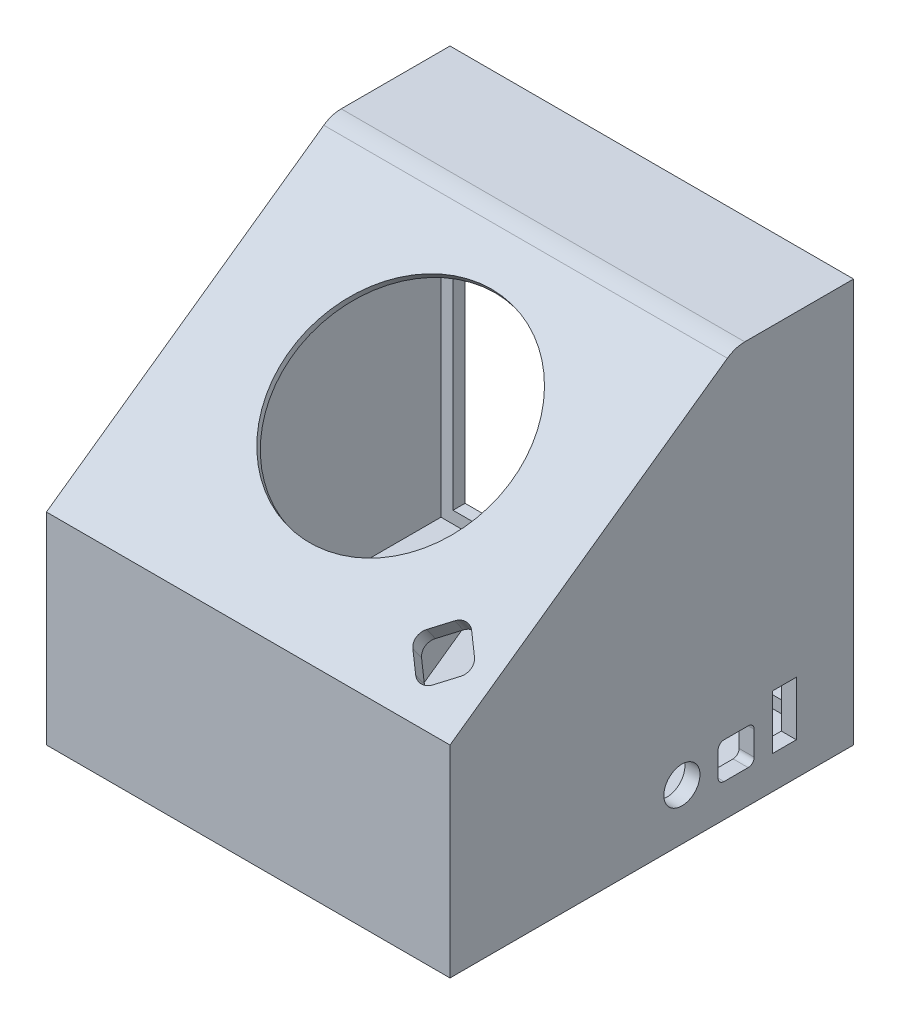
ISO-10303-21;
HEADER;
FILE_DESCRIPTION(('STEP AP214'),'2;1');
FILE_NAME('part.step','',(''),(''),'','','');
FILE_SCHEMA(('AUTOMOTIVE_DESIGN { 1 0 10303 214 1 1 1 1 }'));
ENDSEC;
DATA;
#1=APPLICATION_CONTEXT('core data for automotive mechanical design processes');
#2=APPLICATION_PROTOCOL_DEFINITION('international standard','automotive_design',2000,#1);
#3=PRODUCT_CONTEXT('',#1,'mechanical');
#4=PRODUCT('Part','Part','',(#3));
#5=PRODUCT_RELATED_PRODUCT_CATEGORY('part','',(#4));
#6=PRODUCT_DEFINITION_FORMATION('','',#4);
#7=PRODUCT_DEFINITION_CONTEXT('part definition',#1,'design');
#8=PRODUCT_DEFINITION('design','',#6,#7);
#9=PRODUCT_DEFINITION_SHAPE('','',#8);
#10=(LENGTH_UNIT() NAMED_UNIT(*) SI_UNIT(.MILLI.,.METRE.));
#11=(NAMED_UNIT(*) PLANE_ANGLE_UNIT() SI_UNIT($,.RADIAN.));
#12=(NAMED_UNIT(*) SI_UNIT($,.STERADIAN.) SOLID_ANGLE_UNIT());
#13=UNCERTAINTY_MEASURE_WITH_UNIT(LENGTH_MEASURE(1.E-05),#10,'distance_accuracy_value','');
#14=(GEOMETRIC_REPRESENTATION_CONTEXT(3) GLOBAL_UNCERTAINTY_ASSIGNED_CONTEXT((#13)) GLOBAL_UNIT_ASSIGNED_CONTEXT((#10,
#11,#12)) REPRESENTATION_CONTEXT('',''));
#15=CARTESIAN_POINT('',(0.,0.,0.));
#16=DIRECTION('',(0.,0.,1.));
#17=DIRECTION('',(1.,0.,0.));
#18=AXIS2_PLACEMENT_3D('',#15,#16,#17);
#19=CARTESIAN_POINT('',(30.5,67.,-33.));
#20=DIRECTION('',(-1.,0.,0.));
#21=DIRECTION('',(0.,0.,1.));
#22=AXIS2_PLACEMENT_3D('',#19,#20,#21);
#23=PLANE('',#22);
#24=DIRECTION('',(0.,0.,-1.));
#25=VECTOR('',#24,1.);
#26=CARTESIAN_POINT('',(30.5,2.5,-33.));
#27=LINE('',#26,#25);
#28=CARTESIAN_POINT('',(30.5,2.5,-31.));
#29=VERTEX_POINT('',#28);
#30=CARTESIAN_POINT('',(30.5,2.5,-33.));
#31=VERTEX_POINT('',#30);
#32=EDGE_CURVE('E680',#29,#31,#27,.T.);
#33=ORIENTED_EDGE('',*,*,#32,.F.);
#34=DIRECTION('',(0.,-1.,0.));
#35=VECTOR('',#34,1.);
#36=CARTESIAN_POINT('',(30.5,64.5,-31.));
#37=LINE('',#36,#35);
#38=CARTESIAN_POINT('',(30.5,64.5,-31.));
#39=VERTEX_POINT('',#38);
#40=EDGE_CURVE('E450',#39,#29,#37,.T.);
#41=ORIENTED_EDGE('',*,*,#40,.F.);
#42=DIRECTION('',(0.,0.,-1.));
#43=VECTOR('',#42,1.);
#44=CARTESIAN_POINT('',(30.5,64.5,-33.));
#45=LINE('',#44,#43);
#46=CARTESIAN_POINT('',(30.5,64.5,-33.));
#47=VERTEX_POINT('',#46);
#48=EDGE_CURVE('E666',#39,#47,#45,.T.);
#49=ORIENTED_EDGE('',*,*,#48,.T.);
#50=DIRECTION('',(0.,-1.,0.));
#51=VECTOR('',#50,1.);
#52=CARTESIAN_POINT('',(30.5,67.,-33.));
#53=LINE('',#52,#51);
#54=EDGE_CURVE('E700',#47,#31,#53,.T.);
#55=ORIENTED_EDGE('',*,*,#54,.T.);
#56=EDGE_LOOP('',(#33,#41,#49,#55));
#57=FACE_BOUND('',#56,.T.);
#58=ADVANCED_FACE('F35',(#57),#23,.T.);
#59=CARTESIAN_POINT('',(30.5,8.5,-4.49999999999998));
#60=DIRECTION('',(-1.,0.,0.));
#61=DIRECTION('',(0.,0.,1.));
#62=AXIS2_PLACEMENT_3D('',#59,#60,#61);
#63=CIRCLE('',#62,3.);
#64=CARTESIAN_POINT('',(30.5,8.5,-1.49999999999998));
#65=VERTEX_POINT('',#64);
#66=EDGE_CURVE('E522',#65,#65,#63,.T.);
#67=ORIENTED_EDGE('',*,*,#66,.F.);
#68=EDGE_LOOP('',(#67));
#69=FACE_BOUND('',#68,.T.);
#70=DIRECTION('',(0.,-1.,0.));
#71=VECTOR('',#70,1.);
#72=CARTESIAN_POINT('',(30.5,11.5,-16.5));
#73=LINE('',#72,#71);
#74=CARTESIAN_POINT('',(30.5,10.5,-16.5));
#75=VERTEX_POINT('',#74);
#76=CARTESIAN_POINT('',(30.5,6.5,-16.5));
#77=VERTEX_POINT('',#76);
#78=EDGE_CURVE('E502',#75,#77,#73,.T.);
#79=ORIENTED_EDGE('',*,*,#78,.F.);
#80=CARTESIAN_POINT('',(30.5,10.5,-15.5));
#81=DIRECTION('',(-1.,0.,0.));
#82=DIRECTION('',(0.,0.,1.));
#83=AXIS2_PLACEMENT_3D('',#80,#81,#82);
#84=CIRCLE('',#83,1.);
#85=CARTESIAN_POINT('',(30.5,11.5,-15.5));
#86=VERTEX_POINT('',#85);
#87=EDGE_CURVE('E784',#75,#86,#84,.F.);
#88=ORIENTED_EDGE('',*,*,#87,.T.);
#89=DIRECTION('',(0.,0.,-1.));
#90=VECTOR('',#89,1.);
#91=CARTESIAN_POINT('',(30.5,11.5,-16.5));
#92=LINE('',#91,#90);
#93=CARTESIAN_POINT('',(30.5,11.5,-11.5));
#94=VERTEX_POINT('',#93);
#95=EDGE_CURVE('E513',#94,#86,#92,.T.);
#96=ORIENTED_EDGE('',*,*,#95,.F.);
#97=CARTESIAN_POINT('',(30.5,10.5,-11.5));
#98=DIRECTION('',(-1.,0.,0.));
#99=DIRECTION('',(0.,0.,1.));
#100=AXIS2_PLACEMENT_3D('',#97,#98,#99);
#101=CIRCLE('',#100,1.);
#102=CARTESIAN_POINT('',(30.5,10.5,-10.5));
#103=VERTEX_POINT('',#102);
#104=EDGE_CURVE('E780',#94,#103,#101,.F.);
#105=ORIENTED_EDGE('',*,*,#104,.T.);
#106=DIRECTION('',(0.,1.,0.));
#107=VECTOR('',#106,1.);
#108=CARTESIAN_POINT('',(30.5,11.5,-10.5));
#109=LINE('',#108,#107);
#110=CARTESIAN_POINT('',(30.5,6.5,-10.5));
#111=VERTEX_POINT('',#110);
#112=EDGE_CURVE('E528',#111,#103,#109,.T.);
#113=ORIENTED_EDGE('',*,*,#112,.F.);
#114=CARTESIAN_POINT('',(30.5,6.5,-11.5));
#115=DIRECTION('',(-1.,0.,0.));
#116=DIRECTION('',(0.,0.,1.));
#117=AXIS2_PLACEMENT_3D('',#114,#115,#116);
#118=CIRCLE('',#117,1.);
#119=CARTESIAN_POINT('',(30.5,5.5,-11.5));
#120=VERTEX_POINT('',#119);
#121=EDGE_CURVE('E776',#111,#120,#118,.F.);
#122=ORIENTED_EDGE('',*,*,#121,.T.);
#123=DIRECTION('',(0.,0.,1.));
#124=VECTOR('',#123,1.);
#125=CARTESIAN_POINT('',(30.5,5.5,-16.5));
#126=LINE('',#125,#124);
#127=CARTESIAN_POINT('',(30.5,5.5,-15.5));
#128=VERTEX_POINT('',#127);
#129=EDGE_CURVE('E525',#128,#120,#126,.T.);
#130=ORIENTED_EDGE('',*,*,#129,.F.);
#131=CARTESIAN_POINT('',(30.5,6.5,-15.5));
#132=DIRECTION('',(-1.,0.,0.));
#133=DIRECTION('',(0.,0.,1.));
#134=AXIS2_PLACEMENT_3D('',#131,#132,#133);
#135=CIRCLE('',#134,1.);
#136=EDGE_CURVE('E772',#128,#77,#135,.F.);
#137=ORIENTED_EDGE('',*,*,#136,.T.);
#138=EDGE_LOOP('',(#79,#88,#96,#105,#113,#122,#130,#137));
#139=FACE_BOUND('',#138,.T.);
#140=DIRECTION('',(0.,-1.,0.));
#141=VECTOR('',#140,1.);
#142=CARTESIAN_POINT('',(30.5,14.5,-23.5));
#143=LINE('',#142,#141);
#144=CARTESIAN_POINT('',(30.5,14.5,-23.5));
#145=VERTEX_POINT('',#144);
#146=CARTESIAN_POINT('',(30.5,5.50000000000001,-23.5));
#147=VERTEX_POINT('',#146);
#148=EDGE_CURVE('E476',#145,#147,#143,.T.);
#149=ORIENTED_EDGE('',*,*,#148,.F.);
#150=DIRECTION('',(0.,0.,-1.));
#151=VECTOR('',#150,1.);
#152=CARTESIAN_POINT('',(30.5,14.5,-23.5));
#153=LINE('',#152,#151);
#154=CARTESIAN_POINT('',(30.5,14.5,-19.5));
#155=VERTEX_POINT('',#154);
#156=EDGE_CURVE('E481',#155,#145,#153,.T.);
#157=ORIENTED_EDGE('',*,*,#156,.F.);
#158=DIRECTION('',(0.,1.,0.));
#159=VECTOR('',#158,1.);
#160=CARTESIAN_POINT('',(30.5,14.5,-19.5));
#161=LINE('',#160,#159);
#162=CARTESIAN_POINT('',(30.5,5.5,-19.5));
#163=VERTEX_POINT('',#162);
#164=EDGE_CURVE('E495',#163,#155,#161,.T.);
#165=ORIENTED_EDGE('',*,*,#164,.F.);
#166=DIRECTION('',(0.,0.,1.));
#167=VECTOR('',#166,1.);
#168=CARTESIAN_POINT('',(30.5,5.5,-23.5));
#169=LINE('',#168,#167);
#170=EDGE_CURVE('E492',#147,#163,#169,.T.);
#171=ORIENTED_EDGE('',*,*,#170,.F.);
#172=EDGE_LOOP('',(#149,#157,#165,#171));
#173=FACE_BOUND('',#172,.T.);
#174=CARTESIAN_POINT('',(30.5,64.5,-23.3182326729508));
#175=VERTEX_POINT('',#174);
#176=CARTESIAN_POINT('',(30.5,64.5,-29.));
#177=VERTEX_POINT('',#176);
#178=EDGE_CURVE('E662',#175,#177,#45,.T.);
#179=ORIENTED_EDGE('',*,*,#178,.T.);
#180=DIRECTION('',(0.,1.,0.));
#181=VECTOR('',#180,1.);
#182=CARTESIAN_POINT('',(30.5,64.5,-29.));
#183=LINE('',#182,#181);
#184=CARTESIAN_POINT('',(30.5,2.5,-29.));
#185=VERTEX_POINT('',#184);
#186=EDGE_CURVE('E461',#185,#177,#183,.T.);
#187=ORIENTED_EDGE('',*,*,#186,.F.);
#188=CARTESIAN_POINT('',(30.5,2.5,31.5));
#189=VERTEX_POINT('',#188);
#190=EDGE_CURVE('E676',#189,#185,#27,.T.);
#191=ORIENTED_EDGE('',*,*,#190,.F.);
#192=DIRECTION('',(0.,-1.,0.));
#193=VECTOR('',#192,1.);
#194=CARTESIAN_POINT('',(30.5,67.,31.5));
#195=LINE('',#194,#193);
#196=CARTESIAN_POINT('',(30.5,25.7138879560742,31.5));
#197=VERTEX_POINT('',#196);
#198=EDGE_CURVE('E672',#197,#189,#195,.T.);
#199=ORIENTED_EDGE('',*,*,#198,.F.);
#200=DIRECTION('',(0.,-0.577586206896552,0.816329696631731));
#201=VECTOR('',#200,1.);
#202=CARTESIAN_POINT('',(30.5,69.8989753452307,-30.9488579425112));
#203=LINE('',#202,#201);
#204=CARTESIAN_POINT('',(30.5,28.5765938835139,27.4540033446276));
#205=VERTEX_POINT('',#204);
#206=EDGE_CURVE('E671',#205,#197,#203,.T.);
#207=ORIENTED_EDGE('',*,*,#206,.F.);
#208=DIRECTION('',(0.,-0.816329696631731,-0.577586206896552));
#209=VECTOR('',#208,1.);
#210=CARTESIAN_POINT('',(30.5,32.9031412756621,30.5152102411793));
#211=LINE('',#210,#209);
#212=CARTESIAN_POINT('',(30.5,32.9031412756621,30.5152102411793));
#213=VERTEX_POINT('',#212);
#214=EDGE_CURVE('E589',#213,#205,#211,.T.);
#215=ORIENTED_EDGE('',*,*,#214,.F.);
#216=DIRECTION('',(0.,-0.577586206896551,0.816329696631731));
#217=VECTOR('',#216,1.);
#218=CARTESIAN_POINT('',(30.5,39.8341757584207,20.7192538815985));
#219=LINE('',#218,#217);
#220=CARTESIAN_POINT('',(30.5,39.8341757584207,20.7192538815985));
#221=VERTEX_POINT('',#220);
#222=EDGE_CURVE('E571',#221,#213,#219,.T.);
#223=ORIENTED_EDGE('',*,*,#222,.F.);
#224=DIRECTION('',(0.,-0.816329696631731,-0.577586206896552));
#225=VECTOR('',#224,1.);
#226=CARTESIAN_POINT('',(30.5,39.8341757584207,20.7192538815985));
#227=LINE('',#226,#225);
#228=CARTESIAN_POINT('',(30.5,35.5076283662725,17.6580469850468));
#229=VERTEX_POINT('',#228);
#230=EDGE_CURVE('E591',#221,#229,#227,.T.);
#231=ORIENTED_EDGE('',*,*,#230,.T.);
#232=EDGE_CURVE('E667',#175,#229,#203,.T.);
#233=ORIENTED_EDGE('',*,*,#232,.F.);
#234=EDGE_LOOP('',(#179,#187,#191,#199,#207,#215,#223,#231,#233));
#235=FACE_BOUND('',#234,.T.);
#236=ADVANCED_FACE('F873',(#69,#139,#173,#235),#23,.T.);
#237=CARTESIAN_POINT('',(-31.5,67.,-33.));
#238=DIRECTION('',(1.,0.,0.));
#239=DIRECTION('',(0.,0.,-1.));
#240=AXIS2_PLACEMENT_3D('',#237,#238,#239);
#241=PLANE('',#240);
#242=DIRECTION('',(0.,0.,1.));
#243=VECTOR('',#242,1.);
#244=CARTESIAN_POINT('',(-31.5,64.5,-33.));
#245=LINE('',#244,#243);
#246=CARTESIAN_POINT('',(-31.5,64.5,-33.));
#247=VERTEX_POINT('',#246);
#248=CARTESIAN_POINT('',(-31.5,64.5,-31.));
#249=VERTEX_POINT('',#248);
#250=EDGE_CURVE('E675',#247,#249,#245,.T.);
#251=ORIENTED_EDGE('',*,*,#250,.T.);
#252=DIRECTION('',(0.,-1.,0.));
#253=VECTOR('',#252,1.);
#254=CARTESIAN_POINT('',(-31.5,64.5,-31.));
#255=LINE('',#254,#253);
#256=CARTESIAN_POINT('',(-31.5,2.5,-31.));
#257=VERTEX_POINT('',#256);
#258=EDGE_CURVE('E457',#249,#257,#255,.T.);
#259=ORIENTED_EDGE('',*,*,#258,.T.);
#260=DIRECTION('',(0.,0.,1.));
#261=VECTOR('',#260,1.);
#262=CARTESIAN_POINT('',(-31.5,2.5,-33.));
#263=LINE('',#262,#261);
#264=CARTESIAN_POINT('',(-31.5,2.5,-33.));
#265=VERTEX_POINT('',#264);
#266=EDGE_CURVE('E690',#265,#257,#263,.T.);
#267=ORIENTED_EDGE('',*,*,#266,.F.);
#268=DIRECTION('',(0.,-1.,0.));
#269=VECTOR('',#268,1.);
#270=CARTESIAN_POINT('',(-31.5,67.,-33.));
#271=LINE('',#270,#269);
#272=EDGE_CURVE('E686',#247,#265,#271,.T.);
#273=ORIENTED_EDGE('',*,*,#272,.F.);
#274=EDGE_LOOP('',(#251,#259,#267,#273));
#275=FACE_BOUND('',#274,.T.);
#276=ADVANCED_FACE('F881',(#275),#241,.T.);
#277=DIRECTION('',(0.,-1.,0.));
#278=VECTOR('',#277,1.);
#279=CARTESIAN_POINT('',(-31.5,9.5,25.8));
#280=LINE('',#279,#278);
#281=CARTESIAN_POINT('',(-31.5,9.5,25.8));
#282=VERTEX_POINT('',#281);
#283=CARTESIAN_POINT('',(-31.5,5.5,25.8));
#284=VERTEX_POINT('',#283);
#285=EDGE_CURVE('E50',#282,#284,#280,.T.);
#286=ORIENTED_EDGE('',*,*,#285,.F.);
#287=DIRECTION('',(0.,0.,1.));
#288=VECTOR('',#287,1.);
#289=CARTESIAN_POINT('',(-31.5,9.5,25.8));
#290=LINE('',#289,#288);
#291=CARTESIAN_POINT('',(-31.5,9.5,16.3));
#292=VERTEX_POINT('',#291);
#293=EDGE_CURVE('E406',#292,#282,#290,.T.);
#294=ORIENTED_EDGE('',*,*,#293,.F.);
#295=DIRECTION('',(0.,1.,0.));
#296=VECTOR('',#295,1.);
#297=CARTESIAN_POINT('',(-31.5,9.5,16.3));
#298=LINE('',#297,#296);
#299=CARTESIAN_POINT('',(-31.5,5.5,16.3));
#300=VERTEX_POINT('',#299);
#301=EDGE_CURVE('E409',#300,#292,#298,.T.);
#302=ORIENTED_EDGE('',*,*,#301,.F.);
#303=DIRECTION('',(0.,0.,-1.));
#304=VECTOR('',#303,1.);
#305=CARTESIAN_POINT('',(-31.5,5.5,25.8));
#306=LINE('',#305,#304);
#307=EDGE_CURVE('E415',#284,#300,#306,.T.);
#308=ORIENTED_EDGE('',*,*,#307,.F.);
#309=EDGE_LOOP('',(#286,#294,#302,#308));
#310=FACE_BOUND('',#309,.T.);
#311=CARTESIAN_POINT('',(-31.5,2.5,-29.));
#312=VERTEX_POINT('',#311);
#313=CARTESIAN_POINT('',(-31.5,2.5,31.5));
#314=VERTEX_POINT('',#313);
#315=EDGE_CURVE('E697',#312,#314,#263,.T.);
#316=ORIENTED_EDGE('',*,*,#315,.F.);
#317=DIRECTION('',(0.,1.,0.));
#318=VECTOR('',#317,1.);
#319=CARTESIAN_POINT('',(-31.5,64.5,-29.));
#320=LINE('',#319,#318);
#321=CARTESIAN_POINT('',(-31.5,64.5,-29.));
#322=VERTEX_POINT('',#321);
#323=EDGE_CURVE('E460',#312,#322,#320,.T.);
#324=ORIENTED_EDGE('',*,*,#323,.T.);
#325=CARTESIAN_POINT('',(-31.5,64.5,-23.3182326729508));
#326=VERTEX_POINT('',#325);
#327=EDGE_CURVE('E694',#322,#326,#245,.T.);
#328=ORIENTED_EDGE('',*,*,#327,.T.);
#329=DIRECTION('',(0.,-0.577586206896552,0.816329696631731));
#330=VECTOR('',#329,1.);
#331=CARTESIAN_POINT('',(-31.5,60.6326283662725,-17.8522948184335));
#332=LINE('',#331,#330);
#333=CARTESIAN_POINT('',(-31.5,25.7138879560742,31.5));
#334=VERTEX_POINT('',#333);
#335=EDGE_CURVE('E655',#326,#334,#332,.T.);
#336=ORIENTED_EDGE('',*,*,#335,.T.);
#337=DIRECTION('',(0.,-1.,0.));
#338=VECTOR('',#337,1.);
#339=CARTESIAN_POINT('',(-31.5,67.,31.5));
#340=LINE('',#339,#338);
#341=EDGE_CURVE('E674',#334,#314,#340,.T.);
#342=ORIENTED_EDGE('',*,*,#341,.T.);
#343=EDGE_LOOP('',(#316,#324,#328,#336,#342));
#344=FACE_BOUND('',#343,.T.);
#345=ADVANCED_FACE('F890',(#310,#344),#241,.T.);
#346=CARTESIAN_POINT('',(0.,64.5,0.));
#347=DIRECTION('',(0.,1.,0.));
#348=DIRECTION('',(0.,0.,1.));
#349=AXIS2_PLACEMENT_3D('',#346,#347,#348);
#350=PLANE('',#349);
#351=DIRECTION('',(1.,0.,0.));
#352=VECTOR('',#351,1.);
#353=CARTESIAN_POINT('',(-31.5,64.5,-31.));
#354=LINE('',#353,#352);
#355=EDGE_CURVE('E464',#249,#39,#354,.T.);
#356=ORIENTED_EDGE('',*,*,#355,.F.);
#357=ORIENTED_EDGE('',*,*,#250,.F.);
#358=DIRECTION('',(-1.,0.,0.));
#359=VECTOR('',#358,1.);
#360=CARTESIAN_POINT('',(-34.,64.5,-33.));
#361=LINE('',#360,#359);
#362=EDGE_CURVE('E665',#47,#247,#361,.T.);
#363=ORIENTED_EDGE('',*,*,#362,.F.);
#364=ORIENTED_EDGE('',*,*,#48,.F.);
#365=EDGE_LOOP('',(#356,#357,#363,#364));
#366=FACE_BOUND('',#365,.T.);
#367=ADVANCED_FACE('F897',(#366),#350,.F.);
#368=DIRECTION('',(1.,0.,0.));
#369=VECTOR('',#368,1.);
#370=CARTESIAN_POINT('',(-31.5,64.5,-29.));
#371=LINE('',#370,#369);
#372=EDGE_CURVE('E468',#322,#177,#371,.T.);
#373=ORIENTED_EDGE('',*,*,#372,.T.);
#374=ORIENTED_EDGE('',*,*,#178,.F.);
#375=DIRECTION('',(-1.,0.,0.));
#376=VECTOR('',#375,1.);
#377=CARTESIAN_POINT('',(0.,64.5,-23.3182326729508));
#378=LINE('',#377,#376);
#379=EDGE_CURVE('E670',#175,#326,#378,.T.);
#380=ORIENTED_EDGE('',*,*,#379,.T.);
#381=ORIENTED_EDGE('',*,*,#327,.F.);
#382=EDGE_LOOP('',(#373,#374,#380,#381));
#383=FACE_BOUND('',#382,.T.);
#384=ADVANCED_FACE('F900',(#383),#350,.F.);
#385=CARTESIAN_POINT('',(0.,2.5,0.));
#386=DIRECTION('',(0.,1.,0.));
#387=DIRECTION('',(0.,0.,1.));
#388=AXIS2_PLACEMENT_3D('',#385,#386,#387);
#389=PLANE('',#388);
#390=ORIENTED_EDGE('',*,*,#266,.T.);
#391=DIRECTION('',(1.,0.,0.));
#392=VECTOR('',#391,1.);
#393=CARTESIAN_POINT('',(-31.5,2.5,-31.));
#394=LINE('',#393,#392);
#395=EDGE_CURVE('E473',#257,#29,#394,.T.);
#396=ORIENTED_EDGE('',*,*,#395,.T.);
#397=ORIENTED_EDGE('',*,*,#32,.T.);
#398=DIRECTION('',(-1.,0.,0.));
#399=VECTOR('',#398,1.);
#400=CARTESIAN_POINT('',(-34.,2.5,-33.));
#401=LINE('',#400,#399);
#402=EDGE_CURVE('E679',#31,#265,#401,.T.);
#403=ORIENTED_EDGE('',*,*,#402,.T.);
#404=EDGE_LOOP('',(#390,#396,#397,#403));
#405=FACE_BOUND('',#404,.T.);
#406=ADVANCED_FACE('F902',(#405),#389,.T.);
#407=ORIENTED_EDGE('',*,*,#190,.T.);
#408=DIRECTION('',(1.,0.,0.));
#409=VECTOR('',#408,1.);
#410=CARTESIAN_POINT('',(-31.5,2.5,-29.));
#411=LINE('',#410,#409);
#412=EDGE_CURVE('E471',#312,#185,#411,.T.);
#413=ORIENTED_EDGE('',*,*,#412,.F.);
#414=ORIENTED_EDGE('',*,*,#315,.T.);
#415=DIRECTION('',(1.,0.,0.));
#416=VECTOR('',#415,1.);
#417=CARTESIAN_POINT('',(-34.,2.5,31.5));
#418=LINE('',#417,#416);
#419=EDGE_CURVE('E687',#314,#189,#418,.T.);
#420=ORIENTED_EDGE('',*,*,#419,.T.);
#421=EDGE_LOOP('',(#407,#413,#414,#420));
#422=FACE_BOUND('',#421,.T.);
#423=ADVANCED_FACE('F905',(#422),#389,.T.);
#424=CARTESIAN_POINT('',(0.,36.3144068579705,25.6939084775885));
#425=DIRECTION('',(0.,0.816329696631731,0.577586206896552));
#426=DIRECTION('',(0.,-0.577586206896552,0.816329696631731));
#427=AXIS2_PLACEMENT_3D('',#424,#425,#426);
#428=PLANE('',#427);
#429=DIRECTION('',(1.,0.,0.));
#430=VECTOR('',#429,1.);
#431=CARTESIAN_POINT('',(24.5,39.8341757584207,20.7192538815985));
#432=LINE('',#431,#430);
#433=CARTESIAN_POINT('',(19.1259884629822,39.8341757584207,20.7192538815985));
#434=VERTEX_POINT('',#433);
#435=CARTESIAN_POINT('',(24.5,39.8341757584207,20.7192538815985));
#436=VERTEX_POINT('',#435);
#437=EDGE_CURVE('E568',#434,#436,#432,.T.);
#438=ORIENTED_EDGE('',*,*,#437,.T.);
#439=EDGE_CURVE('E566',#436,#221,#432,.T.);
#440=ORIENTED_EDGE('',*,*,#439,.T.);
#441=ORIENTED_EDGE('',*,*,#222,.T.);
#442=DIRECTION('',(-1.,0.,0.));
#443=VECTOR('',#442,1.);
#444=CARTESIAN_POINT('',(19.1259884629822,32.9031412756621,30.5152102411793));
#445=LINE('',#444,#443);
#446=CARTESIAN_POINT('',(19.1259884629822,32.9031412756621,30.5152102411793));
#447=VERTEX_POINT('',#446);
#448=EDGE_CURVE('E574',#213,#447,#445,.T.);
#449=ORIENTED_EDGE('',*,*,#448,.T.);
#450=DIRECTION('',(0.,0.577586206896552,-0.816329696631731));
#451=VECTOR('',#450,1.);
#452=CARTESIAN_POINT('',(19.1259884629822,39.8341757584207,20.7192538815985));
#453=LINE('',#452,#451);
#454=CARTESIAN_POINT('',(19.1259884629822,36.7302208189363,25.1062190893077));
#455=VERTEX_POINT('',#454);
#456=EDGE_CURVE('E563',#447,#455,#453,.T.);
#457=ORIENTED_EDGE('',*,*,#456,.T.);
#458=EDGE_CURVE('E567',#455,#434,#453,.T.);
#459=ORIENTED_EDGE('',*,*,#458,.T.);
#460=EDGE_LOOP('',(#438,#440,#441,#449,#457,#459));
#461=FACE_BOUND('',#460,.T.);
#462=CARTESIAN_POINT('',(24.5,38.2005152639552,23.0281829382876));
#463=DIRECTION('',(0.,0.816329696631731,0.577586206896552));
#464=DIRECTION('',(0.,-0.577586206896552,0.816329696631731));
#465=AXIS2_PLACEMENT_3D('',#462,#463,#464);
#466=CIRCLE('',#465,2.);
#467=CARTESIAN_POINT('',(25.9142135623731,39.0173455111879,21.873718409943));
#468=VERTEX_POINT('',#467);
#469=CARTESIAN_POINT('',(23.0857864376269,39.0173455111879,21.873718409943));
#470=VERTEX_POINT('',#469);
#471=EDGE_CURVE('E11',#468,#470,#466,.T.);
#472=ORIENTED_EDGE('',*,*,#471,.T.);
#473=DIRECTION('',(-0.707106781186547,-0.408415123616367,0.577232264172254));
#474=VECTOR('',#473,1.);
#475=CARTESIAN_POINT('',(19.1259884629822,36.7302208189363,25.1062190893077));
#476=LINE('',#475,#474);
#477=CARTESIAN_POINT('',(20.5402020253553,37.547051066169,23.9517545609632));
#478=VERTEX_POINT('',#477);
#479=EDGE_CURVE('E539',#470,#478,#476,.T.);
#480=ORIENTED_EDGE('',*,*,#479,.T.);
#481=CARTESIAN_POINT('',(21.9544155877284,36.7302208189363,25.1062190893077));
#482=DIRECTION('',(0.,0.816329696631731,0.577586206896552));
#483=DIRECTION('',(0.,-0.577586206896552,0.816329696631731));
#484=AXIS2_PLACEMENT_3D('',#481,#482,#483);
#485=CIRCLE('',#484,2.);
#486=CARTESIAN_POINT('',(20.5402020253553,35.9133905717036,26.2606836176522));
#487=VERTEX_POINT('',#486);
#488=EDGE_CURVE('E818',#478,#487,#485,.T.);
#489=ORIENTED_EDGE('',*,*,#488,.T.);
#490=DIRECTION('',(0.707106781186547,-0.408415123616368,0.577232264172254));
#491=VECTOR('',#490,1.);
#492=CARTESIAN_POINT('',(24.5,33.6262658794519,29.4931842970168));
#493=LINE('',#492,#491);
#494=CARTESIAN_POINT('',(23.0857864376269,34.4430961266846,28.3387197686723));
#495=VERTEX_POINT('',#494);
#496=EDGE_CURVE('E542',#487,#495,#493,.T.);
#497=ORIENTED_EDGE('',*,*,#496,.T.);
#498=CARTESIAN_POINT('',(24.5,35.2599263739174,27.1842552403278));
#499=DIRECTION('',(0.,0.816329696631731,0.577586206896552));
#500=DIRECTION('',(0.,-0.577586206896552,0.816329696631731));
#501=AXIS2_PLACEMENT_3D('',#498,#499,#500);
#502=CIRCLE('',#501,2.);
#503=CARTESIAN_POINT('',(25.9142135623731,34.4430961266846,28.3387197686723));
#504=VERTEX_POINT('',#503);
#505=EDGE_CURVE('E814',#495,#504,#502,.T.);
#506=ORIENTED_EDGE('',*,*,#505,.T.);
#507=DIRECTION('',(0.707106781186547,0.408415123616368,-0.577232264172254));
#508=VECTOR('',#507,1.);
#509=CARTESIAN_POINT('',(29.8740115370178,36.7302208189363,25.1062190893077));
#510=LINE('',#509,#508);
#511=CARTESIAN_POINT('',(28.4597979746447,35.9133905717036,26.2606836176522));
#512=VERTEX_POINT('',#511);
#513=EDGE_CURVE('E546',#504,#512,#510,.T.);
#514=ORIENTED_EDGE('',*,*,#513,.T.);
#515=CARTESIAN_POINT('',(27.0455844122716,36.7302208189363,25.1062190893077));
#516=DIRECTION('',(0.,0.816329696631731,0.577586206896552));
#517=DIRECTION('',(0.,-0.577586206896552,0.816329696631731));
#518=AXIS2_PLACEMENT_3D('',#515,#516,#517);
#519=CIRCLE('',#518,2.);
#520=CARTESIAN_POINT('',(28.4597979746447,37.547051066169,23.9517545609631));
#521=VERTEX_POINT('',#520);
#522=EDGE_CURVE('E810',#512,#521,#519,.T.);
#523=ORIENTED_EDGE('',*,*,#522,.T.);
#524=DIRECTION('',(-0.707106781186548,0.408415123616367,-0.577232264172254));
#525=VECTOR('',#524,1.);
#526=CARTESIAN_POINT('',(24.5,39.8341757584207,20.7192538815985));
#527=LINE('',#526,#525);
#528=EDGE_CURVE('E549',#521,#468,#527,.T.);
#529=ORIENTED_EDGE('',*,*,#528,.T.);
#530=EDGE_LOOP('',(#472,#480,#489,#497,#506,#514,#523,#529));
#531=FACE_BOUND('',#530,.T.);
#532=ADVANCED_FACE('F835',(#461,#531),#428,.F.);
#533=CARTESIAN_POINT('',(-34.,67.,-33.));
#534=DIRECTION('',(0.,0.,1.));
#535=DIRECTION('',(1.,0.,0.));
#536=AXIS2_PLACEMENT_3D('',#533,#534,#535);
#537=PLANE('',#536);
#538=DIRECTION('',(-1.,0.,0.));
#539=VECTOR('',#538,1.);
#540=CARTESIAN_POINT('',(-34.,0.,-33.));
#541=LINE('',#540,#539);
#542=CARTESIAN_POINT('',(33.,0.,-33.));
#543=VERTEX_POINT('',#542);
#544=CARTESIAN_POINT('',(-34.,0.,-33.));
#545=VERTEX_POINT('',#544);
#546=EDGE_CURVE('E727',#543,#545,#541,.T.);
#547=ORIENTED_EDGE('',*,*,#546,.T.);
#548=DIRECTION('',(0.,-1.,0.));
#549=VECTOR('',#548,1.);
#550=CARTESIAN_POINT('',(-34.,67.,-33.));
#551=LINE('',#550,#549);
#552=CARTESIAN_POINT('',(-34.,67.,-33.));
#553=VERTEX_POINT('',#552);
#554=EDGE_CURVE('E737',#553,#545,#551,.T.);
#555=ORIENTED_EDGE('',*,*,#554,.F.);
#556=DIRECTION('',(-1.,0.,0.));
#557=VECTOR('',#556,1.);
#558=CARTESIAN_POINT('',(-34.,67.,-33.));
#559=LINE('',#558,#557);
#560=CARTESIAN_POINT('',(33.,67.,-33.));
#561=VERTEX_POINT('',#560);
#562=EDGE_CURVE('E718',#561,#553,#559,.T.);
#563=ORIENTED_EDGE('',*,*,#562,.F.);
#564=DIRECTION('',(0.,-1.,0.));
#565=VECTOR('',#564,1.);
#566=CARTESIAN_POINT('',(33.,67.,-33.));
#567=LINE('',#566,#565);
#568=EDGE_CURVE('E740',#561,#543,#567,.T.);
#569=ORIENTED_EDGE('',*,*,#568,.T.);
#570=EDGE_LOOP('',(#547,#555,#563,#569));
#571=FACE_BOUND('',#570,.T.);
#572=ORIENTED_EDGE('',*,*,#402,.F.);
#573=ORIENTED_EDGE('',*,*,#54,.F.);
#574=ORIENTED_EDGE('',*,*,#362,.T.);
#575=ORIENTED_EDGE('',*,*,#272,.T.);
#576=EDGE_LOOP('',(#572,#573,#574,#575));
#577=FACE_BOUND('',#576,.T.);
#578=ADVANCED_FACE('F926',(#571,#577),#537,.F.);
#579=CARTESIAN_POINT('',(33.,67.,-33.));
#580=DIRECTION('',(-1.,0.,0.));
#581=DIRECTION('',(0.,0.,1.));
#582=AXIS2_PLACEMENT_3D('',#579,#580,#581);
#583=PLANE('',#582);
#584=DIRECTION('',(0.,0.,-1.));
#585=VECTOR('',#584,1.);
#586=CARTESIAN_POINT('',(33.,14.5,-23.5));
#587=LINE('',#586,#585);
#588=CARTESIAN_POINT('',(33.,14.5,-19.5));
#589=VERTEX_POINT('',#588);
#590=CARTESIAN_POINT('',(33.,14.5,-23.5));
#591=VERTEX_POINT('',#590);
#592=EDGE_CURVE('E487',#589,#591,#587,.T.);
#593=ORIENTED_EDGE('',*,*,#592,.T.);
#594=DIRECTION('',(0.,-1.,0.));
#595=VECTOR('',#594,1.);
#596=CARTESIAN_POINT('',(33.,14.5,-23.5));
#597=LINE('',#596,#595);
#598=CARTESIAN_POINT('',(33.,5.5,-23.5));
#599=VERTEX_POINT('',#598);
#600=EDGE_CURVE('E477',#591,#599,#597,.T.);
#601=ORIENTED_EDGE('',*,*,#600,.T.);
#602=DIRECTION('',(0.,0.,1.));
#603=VECTOR('',#602,1.);
#604=CARTESIAN_POINT('',(33.,5.5,-23.5));
#605=LINE('',#604,#603);
#606=CARTESIAN_POINT('',(33.,5.50000000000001,-19.5));
#607=VERTEX_POINT('',#606);
#608=EDGE_CURVE('E480',#599,#607,#605,.T.);
#609=ORIENTED_EDGE('',*,*,#608,.T.);
#610=DIRECTION('',(0.,1.,0.));
#611=VECTOR('',#610,1.);
#612=CARTESIAN_POINT('',(33.,14.5,-19.5));
#613=LINE('',#612,#611);
#614=EDGE_CURVE('E484',#607,#589,#613,.T.);
#615=ORIENTED_EDGE('',*,*,#614,.T.);
#616=EDGE_LOOP('',(#593,#601,#609,#615));
#617=FACE_BOUND('',#616,.T.);
#618=DIRECTION('',(0.,1.,0.));
#619=VECTOR('',#618,1.);
#620=CARTESIAN_POINT('',(33.,11.5,-10.5));
#621=LINE('',#620,#619);
#622=CARTESIAN_POINT('',(33.,6.5,-10.5));
#623=VERTEX_POINT('',#622);
#624=CARTESIAN_POINT('',(33.,10.5,-10.5));
#625=VERTEX_POINT('',#624);
#626=EDGE_CURVE('E516',#623,#625,#621,.T.);
#627=ORIENTED_EDGE('',*,*,#626,.T.);
#628=CARTESIAN_POINT('',(33.,10.5,-11.5));
#629=DIRECTION('',(-1.,0.,0.));
#630=DIRECTION('',(0.,0.,1.));
#631=AXIS2_PLACEMENT_3D('',#628,#629,#630);
#632=CIRCLE('',#631,1.);
#633=CARTESIAN_POINT('',(33.,11.5,-11.5));
#634=VERTEX_POINT('',#633);
#635=EDGE_CURVE('E782',#625,#634,#632,.T.);
#636=ORIENTED_EDGE('',*,*,#635,.T.);
#637=DIRECTION('',(0.,0.,-1.));
#638=VECTOR('',#637,1.);
#639=CARTESIAN_POINT('',(33.,11.5,-16.5));
#640=LINE('',#639,#638);
#641=CARTESIAN_POINT('',(33.,11.5,-15.5));
#642=VERTEX_POINT('',#641);
#643=EDGE_CURVE('E519',#634,#642,#640,.T.);
#644=ORIENTED_EDGE('',*,*,#643,.T.);
#645=CARTESIAN_POINT('',(33.,10.5,-15.5));
#646=DIRECTION('',(-1.,0.,0.));
#647=DIRECTION('',(0.,0.,1.));
#648=AXIS2_PLACEMENT_3D('',#645,#646,#647);
#649=CIRCLE('',#648,1.);
#650=CARTESIAN_POINT('',(33.,10.5,-16.5));
#651=VERTEX_POINT('',#650);
#652=EDGE_CURVE('E786',#642,#651,#649,.T.);
#653=ORIENTED_EDGE('',*,*,#652,.T.);
#654=DIRECTION('',(0.,-1.,0.));
#655=VECTOR('',#654,1.);
#656=CARTESIAN_POINT('',(33.,11.5,-16.5));
#657=LINE('',#656,#655);
#658=CARTESIAN_POINT('',(33.,6.5,-16.5));
#659=VERTEX_POINT('',#658);
#660=EDGE_CURVE('E509',#651,#659,#657,.T.);
#661=ORIENTED_EDGE('',*,*,#660,.T.);
#662=CARTESIAN_POINT('',(33.,6.5,-15.5));
#663=DIRECTION('',(-1.,0.,0.));
#664=DIRECTION('',(0.,0.,1.));
#665=AXIS2_PLACEMENT_3D('',#662,#663,#664);
#666=CIRCLE('',#665,1.);
#667=CARTESIAN_POINT('',(33.,5.5,-15.5));
#668=VERTEX_POINT('',#667);
#669=EDGE_CURVE('E774',#659,#668,#666,.T.);
#670=ORIENTED_EDGE('',*,*,#669,.T.);
#671=DIRECTION('',(0.,0.,1.));
#672=VECTOR('',#671,1.);
#673=CARTESIAN_POINT('',(33.,5.5,-16.5));
#674=LINE('',#673,#672);
#675=CARTESIAN_POINT('',(33.,5.5,-11.5));
#676=VERTEX_POINT('',#675);
#677=EDGE_CURVE('E512',#668,#676,#674,.T.);
#678=ORIENTED_EDGE('',*,*,#677,.T.);
#679=CARTESIAN_POINT('',(33.,6.5,-11.5));
#680=DIRECTION('',(-1.,0.,0.));
#681=DIRECTION('',(0.,0.,1.));
#682=AXIS2_PLACEMENT_3D('',#679,#680,#681);
#683=CIRCLE('',#682,1.);
#684=EDGE_CURVE('E778',#676,#623,#683,.T.);
#685=ORIENTED_EDGE('',*,*,#684,.T.);
#686=EDGE_LOOP('',(#627,#636,#644,#653,#661,#670,#678,#685));
#687=FACE_BOUND('',#686,.T.);
#688=CARTESIAN_POINT('',(33.,8.5,-4.49999999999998));
#689=DIRECTION('',(-1.,0.,0.));
#690=DIRECTION('',(0.,0.,1.));
#691=AXIS2_PLACEMENT_3D('',#688,#689,#690);
#692=CIRCLE('',#691,3.);
#693=CARTESIAN_POINT('',(33.,8.5,-1.49999999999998));
#694=VERTEX_POINT('',#693);
#695=EDGE_CURVE('E533',#694,#694,#692,.T.);
#696=ORIENTED_EDGE('',*,*,#695,.T.);
#697=EDGE_LOOP('',(#696));
#698=FACE_BOUND('',#697,.T.);
#699=DIRECTION('',(0.,0.,-1.));
#700=VECTOR('',#699,1.);
#701=CARTESIAN_POINT('',(33.,67.,-33.));
#702=LINE('',#701,#700);
#703=CARTESIAN_POINT('',(33.,67.,-14.9371041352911));
#704=VERTEX_POINT('',#703);
#705=EDGE_CURVE('E716',#704,#561,#702,.T.);
#706=ORIENTED_EDGE('',*,*,#705,.F.);
#707=CARTESIAN_POINT('',(33.,62.,-14.9371041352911));
#708=DIRECTION('',(-1.,0.,0.));
#709=DIRECTION('',(0.,0.,1.));
#710=AXIS2_PLACEMENT_3D('',#707,#708,#709);
#711=CIRCLE('',#710,5.);
#712=CARTESIAN_POINT('',(33.,66.0816484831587,-12.0491731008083));
#713=VERTEX_POINT('',#712);
#714=EDGE_CURVE('E750',#704,#713,#711,.F.);
#715=ORIENTED_EDGE('',*,*,#714,.T.);
#716=DIRECTION('',(0.,-0.577586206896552,0.816329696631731));
#717=VECTOR('',#716,1.);
#718=CARTESIAN_POINT('',(33.,67.,-13.3471224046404));
#719=LINE('',#718,#717);
#720=CARTESIAN_POINT('',(33.,33.5,34.));
#721=VERTEX_POINT('',#720);
#722=EDGE_CURVE('E709',#713,#721,#719,.T.);
#723=ORIENTED_EDGE('',*,*,#722,.T.);
#724=DIRECTION('',(0.,-1.,0.));
#725=VECTOR('',#724,1.);
#726=CARTESIAN_POINT('',(33.,67.,34.));
#727=LINE('',#726,#725);
#728=CARTESIAN_POINT('',(33.,0.,34.));
#729=VERTEX_POINT('',#728);
#730=EDGE_CURVE('E724',#721,#729,#727,.T.);
#731=ORIENTED_EDGE('',*,*,#730,.T.);
#732=DIRECTION('',(0.,0.,-1.));
#733=VECTOR('',#732,1.);
#734=CARTESIAN_POINT('',(33.,0.,-33.));
#735=LINE('',#734,#733);
#736=EDGE_CURVE('E715',#729,#543,#735,.T.);
#737=ORIENTED_EDGE('',*,*,#736,.T.);
#738=ORIENTED_EDGE('',*,*,#568,.F.);
#739=EDGE_LOOP('',(#706,#715,#723,#731,#737,#738));
#740=FACE_BOUND('',#739,.T.);
#741=ADVANCED_FACE('F925',(#617,#687,#698,#740),#583,.F.);
#742=CARTESIAN_POINT('',(-34.,67.,-33.));
#743=DIRECTION('',(1.,0.,0.));
#744=DIRECTION('',(0.,0.,-1.));
#745=AXIS2_PLACEMENT_3D('',#742,#743,#744);
#746=PLANE('',#745);
#747=DIRECTION('',(0.,0.,1.));
#748=VECTOR('',#747,1.);
#749=CARTESIAN_POINT('',(-34.,9.5,25.8));
#750=LINE('',#749,#748);
#751=CARTESIAN_POINT('',(-34.,9.5,16.3));
#752=VERTEX_POINT('',#751);
#753=CARTESIAN_POINT('',(-34.,9.5,25.8));
#754=VERTEX_POINT('',#753);
#755=EDGE_CURVE('E396',#752,#754,#750,.T.);
#756=ORIENTED_EDGE('',*,*,#755,.T.);
#757=DIRECTION('',(0.,-1.,0.));
#758=VECTOR('',#757,1.);
#759=CARTESIAN_POINT('',(-34.,9.5,25.8));
#760=LINE('',#759,#758);
#761=CARTESIAN_POINT('',(-34.,5.5,25.8));
#762=VERTEX_POINT('',#761);
#763=EDGE_CURVE('E390',#754,#762,#760,.T.);
#764=ORIENTED_EDGE('',*,*,#763,.T.);
#765=DIRECTION('',(0.,0.,-1.));
#766=VECTOR('',#765,1.);
#767=CARTESIAN_POINT('',(-34.,5.5,25.8));
#768=LINE('',#767,#766);
#769=CARTESIAN_POINT('',(-34.,5.5,16.3));
#770=VERTEX_POINT('',#769);
#771=EDGE_CURVE('E399',#762,#770,#768,.T.);
#772=ORIENTED_EDGE('',*,*,#771,.T.);
#773=DIRECTION('',(0.,1.,0.));
#774=VECTOR('',#773,1.);
#775=CARTESIAN_POINT('',(-34.,9.5,16.3));
#776=LINE('',#775,#774);
#777=EDGE_CURVE('E58',#770,#752,#776,.T.);
#778=ORIENTED_EDGE('',*,*,#777,.T.);
#779=EDGE_LOOP('',(#756,#764,#772,#778));
#780=FACE_BOUND('',#779,.T.);
#781=DIRECTION('',(0.,-0.577586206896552,0.816329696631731));
#782=VECTOR('',#781,1.);
#783=CARTESIAN_POINT('',(-34.,67.,-13.3471224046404));
#784=LINE('',#783,#782);
#785=CARTESIAN_POINT('',(-34.,66.0816484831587,-12.0491731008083));
#786=VERTEX_POINT('',#785);
#787=CARTESIAN_POINT('',(-34.,33.5,34.));
#788=VERTEX_POINT('',#787);
#789=EDGE_CURVE('E703',#786,#788,#784,.T.);
#790=ORIENTED_EDGE('',*,*,#789,.F.);
#791=CARTESIAN_POINT('',(-34.,62.,-14.9371041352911));
#792=DIRECTION('',(1.,0.,0.));
#793=DIRECTION('',(0.,0.,-1.));
#794=AXIS2_PLACEMENT_3D('',#791,#792,#793);
#795=CIRCLE('',#794,5.);
#796=CARTESIAN_POINT('',(-34.,67.,-14.9371041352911));
#797=VERTEX_POINT('',#796);
#798=EDGE_CURVE('E746',#786,#797,#795,.F.);
#799=ORIENTED_EDGE('',*,*,#798,.T.);
#800=DIRECTION('',(0.,0.,1.));
#801=VECTOR('',#800,1.);
#802=CARTESIAN_POINT('',(-34.,67.,-33.));
#803=LINE('',#802,#801);
#804=EDGE_CURVE('E721',#553,#797,#803,.T.);
#805=ORIENTED_EDGE('',*,*,#804,.F.);
#806=ORIENTED_EDGE('',*,*,#554,.T.);
#807=DIRECTION('',(0.,0.,1.));
#808=VECTOR('',#807,1.);
#809=CARTESIAN_POINT('',(-34.,0.,-33.));
#810=LINE('',#809,#808);
#811=CARTESIAN_POINT('',(-34.,0.,34.));
#812=VERTEX_POINT('',#811);
#813=EDGE_CURVE('E729',#545,#812,#810,.T.);
#814=ORIENTED_EDGE('',*,*,#813,.T.);
#815=DIRECTION('',(0.,-1.,0.));
#816=VECTOR('',#815,1.);
#817=CARTESIAN_POINT('',(-34.,67.,34.));
#818=LINE('',#817,#816);
#819=EDGE_CURVE('E735',#788,#812,#818,.T.);
#820=ORIENTED_EDGE('',*,*,#819,.F.);
#821=EDGE_LOOP('',(#790,#799,#805,#806,#814,#820));
#822=FACE_BOUND('',#821,.T.);
#823=ADVANCED_FACE('F403',(#780,#822),#746,.F.);
#824=CARTESIAN_POINT('',(-34.,67.,34.));
#825=DIRECTION('',(0.,0.,-1.));
#826=DIRECTION('',(-1.,0.,0.));
#827=AXIS2_PLACEMENT_3D('',#824,#825,#826);
#828=PLANE('',#827);
#829=ORIENTED_EDGE('',*,*,#730,.F.);
#830=DIRECTION('',(-1.,0.,0.));
#831=VECTOR('',#830,1.);
#832=CARTESIAN_POINT('',(33.,33.5,34.));
#833=LINE('',#832,#831);
#834=EDGE_CURVE('E711',#721,#788,#833,.T.);
#835=ORIENTED_EDGE('',*,*,#834,.T.);
#836=ORIENTED_EDGE('',*,*,#819,.T.);
#837=DIRECTION('',(1.,0.,0.));
#838=VECTOR('',#837,1.);
#839=CARTESIAN_POINT('',(-34.,0.,34.));
#840=LINE('',#839,#838);
#841=EDGE_CURVE('E719',#812,#729,#840,.T.);
#842=ORIENTED_EDGE('',*,*,#841,.T.);
#843=EDGE_LOOP('',(#829,#835,#836,#842));
#844=FACE_BOUND('',#843,.T.);
#845=ADVANCED_FACE('F915',(#844),#828,.F.);
#846=CARTESIAN_POINT('',(0.,67.,0.));
#847=DIRECTION('',(0.,1.,0.));
#848=DIRECTION('',(0.,0.,1.));
#849=AXIS2_PLACEMENT_3D('',#846,#847,#848);
#850=PLANE('',#849);
#851=ORIENTED_EDGE('',*,*,#804,.T.);
#852=DIRECTION('',(-1.,0.,0.));
#853=VECTOR('',#852,1.);
#854=CARTESIAN_POINT('',(33.,67.,-14.9371041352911));
#855=LINE('',#854,#853);
#856=EDGE_CURVE('E748',#797,#704,#855,.F.);
#857=ORIENTED_EDGE('',*,*,#856,.T.);
#858=ORIENTED_EDGE('',*,*,#705,.T.);
#859=ORIENTED_EDGE('',*,*,#562,.T.);
#860=EDGE_LOOP('',(#851,#857,#858,#859));
#861=FACE_BOUND('',#860,.T.);
#862=ADVANCED_FACE('F912',(#861),#850,.T.);
#863=CARTESIAN_POINT('',(0.,0.,0.));
#864=DIRECTION('',(0.,1.,0.));
#865=DIRECTION('',(0.,0.,1.));
#866=AXIS2_PLACEMENT_3D('',#863,#864,#865);
#867=PLANE('',#866);
#868=ORIENTED_EDGE('',*,*,#736,.F.);
#869=ORIENTED_EDGE('',*,*,#841,.F.);
#870=ORIENTED_EDGE('',*,*,#813,.F.);
#871=ORIENTED_EDGE('',*,*,#546,.F.);
#872=EDGE_LOOP('',(#868,#869,#870,#871));
#873=FACE_BOUND('',#872,.T.);
#874=ADVANCED_FACE('F911',(#873),#867,.F.);
#875=CARTESIAN_POINT('',(33.,67.,-13.3471224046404));
#876=DIRECTION('',(0.,-0.816329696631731,-0.577586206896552));
#877=DIRECTION('',(0.,0.577586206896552,-0.816329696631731));
#878=AXIS2_PLACEMENT_3D('',#875,#876,#877);
#879=PLANE('',#878);
#880=DIRECTION('',(0.707106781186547,-0.408415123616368,0.577232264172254));
#881=VECTOR('',#880,1.);
#882=CARTESIAN_POINT('',(24.5,35.6670901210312,30.9371498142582));
#883=LINE('',#882,#881);
#884=CARTESIAN_POINT('',(20.5402020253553,37.9542148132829,27.7046491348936));
#885=VERTEX_POINT('',#884);
#886=CARTESIAN_POINT('',(23.0857864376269,36.483920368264,29.7826852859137));
#887=VERTEX_POINT('',#886);
#888=EDGE_CURVE('E555',#885,#887,#883,.T.);
#889=ORIENTED_EDGE('',*,*,#888,.F.);
#890=CARTESIAN_POINT('',(21.9544155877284,38.7710450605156,26.550184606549));
#891=DIRECTION('',(0.,-0.816329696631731,-0.577586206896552));
#892=DIRECTION('',(0.,0.577586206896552,-0.816329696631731));
#893=AXIS2_PLACEMENT_3D('',#890,#891,#892);
#894=CIRCLE('',#893,2.);
#895=CARTESIAN_POINT('',(20.5402020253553,39.5878753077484,25.3957200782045));
#896=VERTEX_POINT('',#895);
#897=EDGE_CURVE('E816',#885,#896,#894,.T.);
#898=ORIENTED_EDGE('',*,*,#897,.T.);
#899=DIRECTION('',(-0.707106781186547,-0.408415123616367,0.577232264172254));
#900=VECTOR('',#899,1.);
#901=CARTESIAN_POINT('',(19.1259884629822,38.7710450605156,26.550184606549));
#902=LINE('',#901,#900);
#903=CARTESIAN_POINT('',(23.0857864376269,41.0581697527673,23.3176839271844));
#904=VERTEX_POINT('',#903);
#905=EDGE_CURVE('E536',#904,#896,#902,.T.);
#906=ORIENTED_EDGE('',*,*,#905,.F.);
#907=CARTESIAN_POINT('',(24.5,40.2413395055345,24.4721484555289));
#908=DIRECTION('',(0.,-0.816329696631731,-0.577586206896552));
#909=DIRECTION('',(0.,0.577586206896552,-0.816329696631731));
#910=AXIS2_PLACEMENT_3D('',#907,#908,#909);
#911=CIRCLE('',#910,2.);
#912=CARTESIAN_POINT('',(25.9142135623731,41.0581697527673,23.3176839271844));
#913=VERTEX_POINT('',#912);
#914=EDGE_CURVE('E43',#904,#913,#911,.T.);
#915=ORIENTED_EDGE('',*,*,#914,.T.);
#916=DIRECTION('',(-0.707106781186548,0.408415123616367,-0.577232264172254));
#917=VECTOR('',#916,1.);
#918=CARTESIAN_POINT('',(24.5,41.875,22.1632193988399));
#919=LINE('',#918,#917);
#920=CARTESIAN_POINT('',(28.4597979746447,39.5878753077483,25.3957200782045));
#921=VERTEX_POINT('',#920);
#922=EDGE_CURVE('E543',#921,#913,#919,.T.);
#923=ORIENTED_EDGE('',*,*,#922,.F.);
#924=CARTESIAN_POINT('',(27.0455844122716,38.7710450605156,26.550184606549));
#925=DIRECTION('',(0.,-0.816329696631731,-0.577586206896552));
#926=DIRECTION('',(0.,0.577586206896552,-0.816329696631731));
#927=AXIS2_PLACEMENT_3D('',#924,#925,#926);
#928=CIRCLE('',#927,2.);
#929=CARTESIAN_POINT('',(28.4597979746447,37.9542148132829,27.7046491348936));
#930=VERTEX_POINT('',#929);
#931=EDGE_CURVE('E808',#921,#930,#928,.T.);
#932=ORIENTED_EDGE('',*,*,#931,.T.);
#933=DIRECTION('',(0.707106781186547,0.408415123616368,-0.577232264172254));
#934=VECTOR('',#933,1.);
#935=CARTESIAN_POINT('',(29.8740115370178,38.7710450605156,26.550184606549));
#936=LINE('',#935,#934);
#937=CARTESIAN_POINT('',(25.9142135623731,36.483920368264,29.7826852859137));
#938=VERTEX_POINT('',#937);
#939=EDGE_CURVE('E558',#938,#930,#936,.T.);
#940=ORIENTED_EDGE('',*,*,#939,.F.);
#941=CARTESIAN_POINT('',(24.5,37.3007506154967,28.6282207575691));
#942=DIRECTION('',(0.,-0.816329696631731,-0.577586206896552));
#943=DIRECTION('',(0.,0.577586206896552,-0.816329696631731));
#944=AXIS2_PLACEMENT_3D('',#941,#942,#943);
#945=CIRCLE('',#944,2.);
#946=EDGE_CURVE('E812',#938,#887,#945,.T.);
#947=ORIENTED_EDGE('',*,*,#946,.T.);
#948=EDGE_LOOP('',(#889,#898,#906,#915,#923,#932,#940,#947));
#949=FACE_BOUND('',#948,.T.);
#950=CARTESIAN_POINT('',(-0.500000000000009,51.4051724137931,8.69377940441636));
#951=DIRECTION('',(0.,-0.816329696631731,-0.577586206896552));
#952=DIRECTION('',(0.,0.577586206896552,-0.816329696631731));
#953=AXIS2_PLACEMENT_3D('',#950,#951,#952);
#954=CIRCLE('',#953,18.5);
#955=CARTESIAN_POINT('',(-0.500000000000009,62.0905172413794,-6.40831998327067));
#956=VERTEX_POINT('',#955);
#957=EDGE_CURVE('E594',#956,#956,#954,.T.);
#958=ORIENTED_EDGE('',*,*,#957,.T.);
#959=EDGE_LOOP('',(#958));
#960=FACE_BOUND('',#959,.T.);
#961=ORIENTED_EDGE('',*,*,#722,.F.);
#962=DIRECTION('',(-1.,0.,0.));
#963=VECTOR('',#962,1.);
#964=CARTESIAN_POINT('',(-34.,66.0816484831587,-12.0491731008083));
#965=LINE('',#964,#963);
#966=EDGE_CURVE('E743',#713,#786,#965,.T.);
#967=ORIENTED_EDGE('',*,*,#966,.T.);
#968=ORIENTED_EDGE('',*,*,#789,.T.);
#969=ORIENTED_EDGE('',*,*,#834,.F.);
#970=EDGE_LOOP('',(#961,#967,#968,#969));
#971=FACE_BOUND('',#970,.T.);
#972=ADVANCED_FACE('F824',(#949,#960,#971),#879,.F.);
#973=CARTESIAN_POINT('',(-34.,67.,31.5));
#974=DIRECTION('',(0.,0.,-1.));
#975=DIRECTION('',(-1.,0.,0.));
#976=AXIS2_PLACEMENT_3D('',#973,#974,#975);
#977=PLANE('',#976);
#978=ORIENTED_EDGE('',*,*,#198,.T.);
#979=ORIENTED_EDGE('',*,*,#419,.F.);
#980=ORIENTED_EDGE('',*,*,#341,.F.);
#981=DIRECTION('',(-1.,0.,0.));
#982=VECTOR('',#981,1.);
#983=CARTESIAN_POINT('',(-34.,25.7138879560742,31.5));
#984=LINE('',#983,#982);
#985=EDGE_CURVE('E681',#197,#334,#984,.T.);
#986=ORIENTED_EDGE('',*,*,#985,.F.);
#987=EDGE_LOOP('',(#978,#979,#980,#986));
#988=FACE_BOUND('',#987,.T.);
#989=ADVANCED_FACE('F892',(#988),#977,.T.);
#990=CARTESIAN_POINT('',(33.,60.6326283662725,-17.8522948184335));
#991=DIRECTION('',(0.,-0.816329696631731,-0.577586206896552));
#992=DIRECTION('',(0.,0.577586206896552,-0.816329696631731));
#993=AXIS2_PLACEMENT_3D('',#990,#991,#992);
#994=PLANE('',#993);
#995=DIRECTION('',(-1.,0.,0.));
#996=VECTOR('',#995,1.);
#997=CARTESIAN_POINT('',(19.1259884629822,28.5765938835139,27.4540033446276));
#998=LINE('',#997,#996);
#999=CARTESIAN_POINT('',(19.1259884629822,28.5765938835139,27.4540033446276));
#1000=VERTEX_POINT('',#999);
#1001=EDGE_CURVE('E580',#205,#1000,#998,.T.);
#1002=ORIENTED_EDGE('',*,*,#1001,.F.);
#1003=ORIENTED_EDGE('',*,*,#206,.T.);
#1004=ORIENTED_EDGE('',*,*,#985,.T.);
#1005=ORIENTED_EDGE('',*,*,#335,.F.);
#1006=ORIENTED_EDGE('',*,*,#379,.F.);
#1007=ORIENTED_EDGE('',*,*,#232,.T.);
#1008=DIRECTION('',(1.,0.,0.));
#1009=VECTOR('',#1008,1.);
#1010=CARTESIAN_POINT('',(24.5,35.5076283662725,17.6580469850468));
#1011=LINE('',#1010,#1009);
#1012=CARTESIAN_POINT('',(19.1259884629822,35.5076283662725,17.6580469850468));
#1013=VERTEX_POINT('',#1012);
#1014=EDGE_CURVE('E552',#1013,#229,#1011,.T.);
#1015=ORIENTED_EDGE('',*,*,#1014,.F.);
#1016=DIRECTION('',(0.,0.577586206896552,-0.816329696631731));
#1017=VECTOR('',#1016,1.);
#1018=CARTESIAN_POINT('',(19.1259884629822,32.4036734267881,22.0450121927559));
#1019=LINE('',#1018,#1017);
#1020=EDGE_CURVE('E583',#1000,#1013,#1019,.T.);
#1021=ORIENTED_EDGE('',*,*,#1020,.F.);
#1022=EDGE_LOOP('',(#1002,#1003,#1004,#1005,#1006,#1007,#1015,#1021));
#1023=FACE_BOUND('',#1022,.T.);
#1024=CARTESIAN_POINT('',(-0.50000000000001,45.0378007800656,4.18860699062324));
#1025=DIRECTION('',(0.,-0.816329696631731,-0.577586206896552));
#1026=DIRECTION('',(0.,0.577586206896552,-0.816329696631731));
#1027=AXIS2_PLACEMENT_3D('',#1024,#1025,#1026);
#1028=CIRCLE('',#1027,24.);
#1029=CARTESIAN_POINT('',(-19.,36.2071517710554,16.669377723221));
#1030=VERTEX_POINT('',#1029);
#1031=CARTESIAN_POINT('',(18.,36.2071517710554,16.669377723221));
#1032=VERTEX_POINT('',#1031);
#1033=EDGE_CURVE('E622',#1030,#1032,#1028,.T.);
#1034=ORIENTED_EDGE('',*,*,#1033,.F.);
#1035=DIRECTION('',(0.,0.577586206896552,-0.816329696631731));
#1036=VECTOR('',#1035,1.);
#1037=CARTESIAN_POINT('',(-19.,36.2071517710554,16.669377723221));
#1038=LINE('',#1037,#1036);
#1039=CARTESIAN_POINT('',(-19.,28.8653869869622,27.0458384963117));
#1040=VERTEX_POINT('',#1039);
#1041=EDGE_CURVE('E633',#1040,#1030,#1038,.T.);
#1042=ORIENTED_EDGE('',*,*,#1041,.F.);
#1043=DIRECTION('',(-1.,0.,0.));
#1044=VECTOR('',#1043,1.);
#1045=CARTESIAN_POINT('',(-19.,28.8653869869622,27.0458384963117));
#1046=LINE('',#1045,#1044);
#1047=CARTESIAN_POINT('',(18.,28.8653869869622,27.0458384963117));
#1048=VERTEX_POINT('',#1047);
#1049=EDGE_CURVE('E648',#1048,#1040,#1046,.T.);
#1050=ORIENTED_EDGE('',*,*,#1049,.F.);
#1051=DIRECTION('',(0.,-0.577586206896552,0.816329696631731));
#1052=VECTOR('',#1051,1.);
#1053=CARTESIAN_POINT('',(18.,36.2071517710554,16.669377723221));
#1054=LINE('',#1053,#1052);
#1055=EDGE_CURVE('E645',#1032,#1048,#1054,.T.);
#1056=ORIENTED_EDGE('',*,*,#1055,.F.);
#1057=EDGE_LOOP('',(#1034,#1042,#1050,#1056));
#1058=FACE_BOUND('',#1057,.T.);
#1059=ADVANCED_FACE('F895',(#1023,#1058),#994,.T.);
#1060=CARTESIAN_POINT('',(-0.500000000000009,46.9153590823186,5.51705526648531));
#1061=DIRECTION('',(0.,-0.816329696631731,-0.577586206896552));
#1062=DIRECTION('',(0.,0.577586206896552,-0.816329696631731));
#1063=AXIS2_PLACEMENT_3D('',#1060,#1061,#1062);
#1064=CYLINDRICAL_SURFACE('',#1063,24.);
#1065=ORIENTED_EDGE('',*,*,#1033,.T.);
#1066=DIRECTION('',(0.,-0.816329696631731,-0.577586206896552));
#1067=VECTOR('',#1066,1.);
#1068=CARTESIAN_POINT('',(18.,38.0847100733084,17.997825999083));
#1069=LINE('',#1068,#1067);
#1070=CARTESIAN_POINT('',(18.,38.0847100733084,17.997825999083));
#1071=VERTEX_POINT('',#1070);
#1072=EDGE_CURVE('E643',#1071,#1032,#1069,.T.);
#1073=ORIENTED_EDGE('',*,*,#1072,.F.);
#1074=CARTESIAN_POINT('',(-0.500000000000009,46.9153590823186,5.51705526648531));
#1075=DIRECTION('',(0.,-0.816329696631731,-0.577586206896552));
#1076=DIRECTION('',(0.,0.577586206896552,-0.816329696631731));
#1077=AXIS2_PLACEMENT_3D('',#1074,#1075,#1076);
#1078=CIRCLE('',#1077,24.);
#1079=CARTESIAN_POINT('',(-19.,38.0847100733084,17.997825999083));
#1080=VERTEX_POINT('',#1079);
#1081=EDGE_CURVE('E629',#1080,#1071,#1078,.T.);
#1082=ORIENTED_EDGE('',*,*,#1081,.F.);
#1083=DIRECTION('',(0.,-0.816329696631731,-0.577586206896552));
#1084=VECTOR('',#1083,1.);
#1085=CARTESIAN_POINT('',(-19.,38.0847100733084,17.997825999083));
#1086=LINE('',#1085,#1084);
#1087=EDGE_CURVE('E653',#1080,#1030,#1086,.T.);
#1088=ORIENTED_EDGE('',*,*,#1087,.T.);
#1089=EDGE_LOOP('',(#1065,#1073,#1082,#1088));
#1090=FACE_BOUND('',#1089,.T.);
#1091=ADVANCED_FACE('F886',(#1090),#1064,.F.);
#1092=CARTESIAN_POINT('',(-19.,38.0847100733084,17.997825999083));
#1093=DIRECTION('',(-1.,0.,0.));
#1094=DIRECTION('',(0.,-1.,0.));
#1095=AXIS2_PLACEMENT_3D('',#1092,#1093,#1094);
#1096=PLANE('',#1095);
#1097=ORIENTED_EDGE('',*,*,#1041,.T.);
#1098=ORIENTED_EDGE('',*,*,#1087,.F.);
#1099=DIRECTION('',(0.,0.577586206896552,-0.816329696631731));
#1100=VECTOR('',#1099,1.);
#1101=CARTESIAN_POINT('',(-19.,38.0847100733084,17.997825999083));
#1102=LINE('',#1101,#1100);
#1103=CARTESIAN_POINT('',(-19.,30.7429452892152,28.3742867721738));
#1104=VERTEX_POINT('',#1103);
#1105=EDGE_CURVE('E640',#1104,#1080,#1102,.T.);
#1106=ORIENTED_EDGE('',*,*,#1105,.F.);
#1107=DIRECTION('',(0.,-0.816329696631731,-0.577586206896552));
#1108=VECTOR('',#1107,1.);
#1109=CARTESIAN_POINT('',(-19.,30.7429452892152,28.3742867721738));
#1110=LINE('',#1109,#1108);
#1111=EDGE_CURVE('E656',#1104,#1040,#1110,.T.);
#1112=ORIENTED_EDGE('',*,*,#1111,.T.);
#1113=EDGE_LOOP('',(#1097,#1098,#1106,#1112));
#1114=FACE_BOUND('',#1113,.T.);
#1115=ADVANCED_FACE('F1166',(#1114),#1096,.F.);
#1116=CARTESIAN_POINT('',(-19.,30.7429452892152,28.3742867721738));
#1117=DIRECTION('',(0.,-0.577586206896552,0.816329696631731));
#1118=DIRECTION('',(0.,-0.816329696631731,-0.577586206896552));
#1119=AXIS2_PLACEMENT_3D('',#1116,#1117,#1118);
#1120=PLANE('',#1119);
#1121=ORIENTED_EDGE('',*,*,#1049,.T.);
#1122=ORIENTED_EDGE('',*,*,#1111,.F.);
#1123=DIRECTION('',(-1.,0.,0.));
#1124=VECTOR('',#1123,1.);
#1125=CARTESIAN_POINT('',(-19.,30.7429452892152,28.3742867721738));
#1126=LINE('',#1125,#1124);
#1127=CARTESIAN_POINT('',(-12.,30.7429452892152,28.3742867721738));
#1128=VERTEX_POINT('',#1127);
#1129=EDGE_CURVE('E636',#1128,#1104,#1126,.T.);
#1130=ORIENTED_EDGE('',*,*,#1129,.F.);
#1131=DIRECTION('',(0.,-0.816329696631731,-0.577586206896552));
#1132=VECTOR('',#1131,1.);
#1133=CARTESIAN_POINT('',(-12.,34.416428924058,30.9734247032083));
#1134=LINE('',#1133,#1132);
#1135=CARTESIAN_POINT('',(-12.,34.416428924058,30.9734247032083));
#1136=VERTEX_POINT('',#1135);
#1137=EDGE_CURVE('E623',#1136,#1128,#1134,.T.);
#1138=ORIENTED_EDGE('',*,*,#1137,.F.);
#1139=DIRECTION('',(-1.,0.,0.));
#1140=VECTOR('',#1139,1.);
#1141=CARTESIAN_POINT('',(-12.,34.416428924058,30.9734247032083));
#1142=LINE('',#1141,#1140);
#1143=CARTESIAN_POINT('',(13.,34.416428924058,30.9734247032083));
#1144=VERTEX_POINT('',#1143);
#1145=EDGE_CURVE('E607',#1144,#1136,#1142,.T.);
#1146=ORIENTED_EDGE('',*,*,#1145,.F.);
#1147=DIRECTION('',(0.,-0.816329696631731,-0.577586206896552));
#1148=VECTOR('',#1147,1.);
#1149=CARTESIAN_POINT('',(13.,34.416428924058,30.9734247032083));
#1150=LINE('',#1149,#1148);
#1151=CARTESIAN_POINT('',(13.,30.7429452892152,28.3742867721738));
#1152=VERTEX_POINT('',#1151);
#1153=EDGE_CURVE('E625',#1144,#1152,#1150,.T.);
#1154=ORIENTED_EDGE('',*,*,#1153,.T.);
#1155=CARTESIAN_POINT('',(18.,30.7429452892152,28.3742867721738));
#1156=VERTEX_POINT('',#1155);
#1157=EDGE_CURVE('E637',#1156,#1152,#1126,.T.);
#1158=ORIENTED_EDGE('',*,*,#1157,.F.);
#1159=DIRECTION('',(0.,-0.816329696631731,-0.577586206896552));
#1160=VECTOR('',#1159,1.);
#1161=CARTESIAN_POINT('',(18.,30.7429452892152,28.3742867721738));
#1162=LINE('',#1161,#1160);
#1163=EDGE_CURVE('E658',#1156,#1048,#1162,.T.);
#1164=ORIENTED_EDGE('',*,*,#1163,.T.);
#1165=EDGE_LOOP('',(#1121,#1122,#1130,#1138,#1146,#1154,#1158,#1164));
#1166=FACE_BOUND('',#1165,.T.);
#1167=ADVANCED_FACE('F1169',(#1166),#1120,.F.);
#1168=CARTESIAN_POINT('',(18.,38.0847100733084,17.997825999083));
#1169=DIRECTION('',(1.,0.,0.));
#1170=DIRECTION('',(0.,0.,-1.));
#1171=AXIS2_PLACEMENT_3D('',#1168,#1169,#1170);
#1172=PLANE('',#1171);
#1173=ORIENTED_EDGE('',*,*,#1055,.T.);
#1174=ORIENTED_EDGE('',*,*,#1163,.F.);
#1175=DIRECTION('',(0.,-0.577586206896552,0.816329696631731));
#1176=VECTOR('',#1175,1.);
#1177=CARTESIAN_POINT('',(18.,38.0847100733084,17.997825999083));
#1178=LINE('',#1177,#1176);
#1179=EDGE_CURVE('E632',#1071,#1156,#1178,.T.);
#1180=ORIENTED_EDGE('',*,*,#1179,.F.);
#1181=ORIENTED_EDGE('',*,*,#1072,.T.);
#1182=EDGE_LOOP('',(#1173,#1174,#1180,#1181));
#1183=FACE_BOUND('',#1182,.T.);
#1184=ADVANCED_FACE('F1164',(#1183),#1172,.F.);
#1185=CARTESIAN_POINT('',(-0.500000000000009,46.9153590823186,5.51705526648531));
#1186=DIRECTION('',(0.,-0.816329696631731,-0.577586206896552));
#1187=DIRECTION('',(0.,0.577586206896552,-0.816329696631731));
#1188=AXIS2_PLACEMENT_3D('',#1185,#1186,#1187);
#1189=PLANE('',#1188);
#1190=DIRECTION('',(0.,0.577586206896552,-0.816329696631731));
#1191=VECTOR('',#1190,1.);
#1192=CARTESIAN_POINT('',(-12.,36.0827301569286,20.8273181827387));
#1193=LINE('',#1192,#1191);
#1194=CARTESIAN_POINT('',(-12.,36.0827301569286,20.8273181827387));
#1195=VERTEX_POINT('',#1194);
#1196=EDGE_CURVE('E604',#1128,#1195,#1193,.T.);
#1197=ORIENTED_EDGE('',*,*,#1196,.F.);
#1198=ORIENTED_EDGE('',*,*,#1129,.T.);
#1199=ORIENTED_EDGE('',*,*,#1105,.T.);
#1200=ORIENTED_EDGE('',*,*,#1081,.T.);
#1201=ORIENTED_EDGE('',*,*,#1179,.T.);
#1202=ORIENTED_EDGE('',*,*,#1157,.T.);
#1203=DIRECTION('',(0.,-0.577586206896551,0.816329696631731));
#1204=VECTOR('',#1203,1.);
#1205=CARTESIAN_POINT('',(13.,36.8821363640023,19.697479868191));
#1206=LINE('',#1205,#1204);
#1207=CARTESIAN_POINT('',(13.,36.8821363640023,19.697479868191));
#1208=VERTEX_POINT('',#1207);
#1209=EDGE_CURVE('E615',#1208,#1152,#1206,.T.);
#1210=ORIENTED_EDGE('',*,*,#1209,.F.);
#1211=CARTESIAN_POINT('',(-0.500000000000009,46.9153590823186,5.51705526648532));
#1212=DIRECTION('',(0.,-0.816329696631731,-0.577586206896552));
#1213=DIRECTION('',(0.,0.577586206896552,-0.816329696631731));
#1214=AXIS2_PLACEMENT_3D('',#1211,#1212,#1213);
#1215=CIRCLE('',#1214,22.);
#1216=EDGE_CURVE('E597',#1195,#1208,#1215,.T.);
#1217=ORIENTED_EDGE('',*,*,#1216,.F.);
#1218=EDGE_LOOP('',(#1197,#1198,#1199,#1200,#1201,#1202,#1210,#1217));
#1219=FACE_BOUND('',#1218,.T.);
#1220=ADVANCED_FACE('F1160',(#1219),#1189,.T.);
#1221=CARTESIAN_POINT('',(-0.500000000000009,50.5888427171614,8.1161931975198));
#1222=DIRECTION('',(0.,-0.816329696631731,-0.577586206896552));
#1223=DIRECTION('',(0.,0.577586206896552,-0.816329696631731));
#1224=AXIS2_PLACEMENT_3D('',#1221,#1222,#1223);
#1225=CYLINDRICAL_SURFACE('',#1224,22.);
#1226=ORIENTED_EDGE('',*,*,#1216,.T.);
#1227=DIRECTION('',(0.,-0.816329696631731,-0.577586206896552));
#1228=VECTOR('',#1227,1.);
#1229=CARTESIAN_POINT('',(13.,40.5556199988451,22.2966177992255));
#1230=LINE('',#1229,#1228);
#1231=CARTESIAN_POINT('',(13.,40.5556199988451,22.2966177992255));
#1232=VERTEX_POINT('',#1231);
#1233=EDGE_CURVE('E613',#1232,#1208,#1230,.T.);
#1234=ORIENTED_EDGE('',*,*,#1233,.F.);
#1235=CARTESIAN_POINT('',(-0.500000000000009,50.5888427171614,8.1161931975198));
#1236=DIRECTION('',(0.,-0.816329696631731,-0.577586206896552));
#1237=DIRECTION('',(0.,0.577586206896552,-0.816329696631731));
#1238=AXIS2_PLACEMENT_3D('',#1235,#1236,#1237);
#1239=CIRCLE('',#1238,22.);
#1240=CARTESIAN_POINT('',(-12.,39.7562137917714,23.4264561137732));
#1241=VERTEX_POINT('',#1240);
#1242=EDGE_CURVE('E600',#1241,#1232,#1239,.T.);
#1243=ORIENTED_EDGE('',*,*,#1242,.F.);
#1244=DIRECTION('',(0.,-0.816329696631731,-0.577586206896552));
#1245=VECTOR('',#1244,1.);
#1246=CARTESIAN_POINT('',(-12.,39.7562137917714,23.4264561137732));
#1247=LINE('',#1246,#1245);
#1248=EDGE_CURVE('E620',#1241,#1195,#1247,.T.);
#1249=ORIENTED_EDGE('',*,*,#1248,.T.);
#1250=EDGE_LOOP('',(#1226,#1234,#1243,#1249));
#1251=FACE_BOUND('',#1250,.T.);
#1252=ADVANCED_FACE('F1153',(#1251),#1225,.F.);
#1253=CARTESIAN_POINT('',(-12.,39.7562137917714,23.4264561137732));
#1254=DIRECTION('',(-1.,0.,0.));
#1255=DIRECTION('',(0.,0.,1.));
#1256=AXIS2_PLACEMENT_3D('',#1253,#1254,#1255);
#1257=PLANE('',#1256);
#1258=ORIENTED_EDGE('',*,*,#1196,.T.);
#1259=ORIENTED_EDGE('',*,*,#1248,.F.);
#1260=DIRECTION('',(0.,0.577586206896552,-0.816329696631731));
#1261=VECTOR('',#1260,1.);
#1262=CARTESIAN_POINT('',(-12.,39.7562137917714,23.4264561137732));
#1263=LINE('',#1262,#1261);
#1264=EDGE_CURVE('E610',#1136,#1241,#1263,.T.);
#1265=ORIENTED_EDGE('',*,*,#1264,.F.);
#1266=ORIENTED_EDGE('',*,*,#1137,.T.);
#1267=EDGE_LOOP('',(#1258,#1259,#1265,#1266));
#1268=FACE_BOUND('',#1267,.T.);
#1269=ADVANCED_FACE('F1150',(#1268),#1257,.F.);
#1270=CARTESIAN_POINT('',(13.,40.5556199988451,22.2966177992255));
#1271=DIRECTION('',(1.,0.,0.));
#1272=DIRECTION('',(0.,0.,-1.));
#1273=AXIS2_PLACEMENT_3D('',#1270,#1271,#1272);
#1274=PLANE('',#1273);
#1275=ORIENTED_EDGE('',*,*,#1209,.T.);
#1276=ORIENTED_EDGE('',*,*,#1153,.F.);
#1277=DIRECTION('',(0.,-0.577586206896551,0.816329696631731));
#1278=VECTOR('',#1277,1.);
#1279=CARTESIAN_POINT('',(13.,40.5556199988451,22.2966177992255));
#1280=LINE('',#1279,#1278);
#1281=EDGE_CURVE('E603',#1232,#1144,#1280,.T.);
#1282=ORIENTED_EDGE('',*,*,#1281,.F.);
#1283=ORIENTED_EDGE('',*,*,#1233,.T.);
#1284=EDGE_LOOP('',(#1275,#1276,#1282,#1283));
#1285=FACE_BOUND('',#1284,.T.);
#1286=ADVANCED_FACE('F1148',(#1285),#1274,.F.);
#1287=CARTESIAN_POINT('',(-0.500000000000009,50.5888427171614,8.1161931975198));
#1288=DIRECTION('',(0.,-0.816329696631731,-0.577586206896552));
#1289=DIRECTION('',(0.,0.577586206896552,-0.816329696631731));
#1290=AXIS2_PLACEMENT_3D('',#1287,#1288,#1289);
#1291=PLANE('',#1290);
#1292=CARTESIAN_POINT('',(-0.500000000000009,50.5888427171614,8.1161931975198));
#1293=DIRECTION('',(0.,-0.816329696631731,-0.577586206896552));
#1294=DIRECTION('',(0.,0.577586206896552,-0.816329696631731));
#1295=AXIS2_PLACEMENT_3D('',#1292,#1293,#1294);
#1296=CIRCLE('',#1295,18.5);
#1297=CARTESIAN_POINT('',(-0.500000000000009,61.2741875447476,-6.98590619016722));
#1298=VERTEX_POINT('',#1297);
#1299=EDGE_CURVE('E588',#1298,#1298,#1296,.T.);
#1300=ORIENTED_EDGE('',*,*,#1299,.F.);
#1301=EDGE_LOOP('',(#1300));
#1302=FACE_BOUND('',#1301,.T.);
#1303=ORIENTED_EDGE('',*,*,#1242,.T.);
#1304=ORIENTED_EDGE('',*,*,#1281,.T.);
#1305=ORIENTED_EDGE('',*,*,#1145,.T.);
#1306=ORIENTED_EDGE('',*,*,#1264,.T.);
#1307=EDGE_LOOP('',(#1303,#1304,#1305,#1306));
#1308=FACE_BOUND('',#1307,.T.);
#1309=ADVANCED_FACE('F1142',(#1302,#1308),#1291,.T.);
#1310=CARTESIAN_POINT('',(-0.500000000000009,51.4051724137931,8.69377940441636));
#1311=DIRECTION('',(0.,-0.816329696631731,-0.577586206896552));
#1312=DIRECTION('',(0.,0.577586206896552,-0.816329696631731));
#1313=AXIS2_PLACEMENT_3D('',#1310,#1311,#1312);
#1314=CYLINDRICAL_SURFACE('',#1313,18.5);
#1315=ORIENTED_EDGE('',*,*,#957,.F.);
#1316=EDGE_LOOP('',(#1315));
#1317=FACE_BOUND('',#1316,.T.);
#1318=ORIENTED_EDGE('',*,*,#1299,.T.);
#1319=EDGE_LOOP('',(#1318));
#1320=FACE_BOUND('',#1319,.T.);
#1321=ADVANCED_FACE('F1135',(#1317,#1320),#1314,.F.);
#1322=CARTESIAN_POINT('',(19.1259884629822,36.7302208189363,25.1062190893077));
#1323=DIRECTION('',(-1.,0.,0.));
#1324=DIRECTION('',(0.,-1.,0.));
#1325=AXIS2_PLACEMENT_3D('',#1322,#1323,#1324);
#1326=PLANE('',#1325);
#1327=ORIENTED_EDGE('',*,*,#1020,.T.);
#1328=DIRECTION('',(0.,-0.816329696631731,-0.577586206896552));
#1329=VECTOR('',#1328,1.);
#1330=CARTESIAN_POINT('',(19.1259884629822,39.8341757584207,20.7192538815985));
#1331=LINE('',#1330,#1329);
#1332=EDGE_CURVE('E577',#434,#1013,#1331,.T.);
#1333=ORIENTED_EDGE('',*,*,#1332,.F.);
#1334=ORIENTED_EDGE('',*,*,#458,.F.);
#1335=ORIENTED_EDGE('',*,*,#456,.F.);
#1336=DIRECTION('',(0.,-0.816329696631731,-0.577586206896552));
#1337=VECTOR('',#1336,1.);
#1338=CARTESIAN_POINT('',(19.1259884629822,32.9031412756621,30.5152102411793));
#1339=LINE('',#1338,#1337);
#1340=EDGE_CURVE('E586',#447,#1000,#1339,.T.);
#1341=ORIENTED_EDGE('',*,*,#1340,.T.);
#1342=EDGE_LOOP('',(#1327,#1333,#1334,#1335,#1341));
#1343=FACE_BOUND('',#1342,.T.);
#1344=ADVANCED_FACE('F1133',(#1343),#1326,.F.);
#1345=CARTESIAN_POINT('',(19.1259884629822,32.9031412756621,30.5152102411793));
#1346=DIRECTION('',(0.,-0.577586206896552,0.816329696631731));
#1347=DIRECTION('',(0.,-0.816329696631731,-0.577586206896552));
#1348=AXIS2_PLACEMENT_3D('',#1345,#1346,#1347);
#1349=PLANE('',#1348);
#1350=ORIENTED_EDGE('',*,*,#1001,.T.);
#1351=ORIENTED_EDGE('',*,*,#1340,.F.);
#1352=ORIENTED_EDGE('',*,*,#448,.F.);
#1353=ORIENTED_EDGE('',*,*,#214,.T.);
#1354=EDGE_LOOP('',(#1350,#1351,#1352,#1353));
#1355=FACE_BOUND('',#1354,.T.);
#1356=ADVANCED_FACE('F867',(#1355),#1349,.F.);
#1357=CARTESIAN_POINT('',(24.5,39.8341757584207,20.7192538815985));
#1358=DIRECTION('',(0.,0.577586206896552,-0.816329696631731));
#1359=DIRECTION('',(0.,0.816329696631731,0.577586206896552));
#1360=AXIS2_PLACEMENT_3D('',#1357,#1358,#1359);
#1361=PLANE('',#1360);
#1362=ORIENTED_EDGE('',*,*,#1014,.T.);
#1363=ORIENTED_EDGE('',*,*,#230,.F.);
#1364=ORIENTED_EDGE('',*,*,#439,.F.);
#1365=ORIENTED_EDGE('',*,*,#437,.F.);
#1366=ORIENTED_EDGE('',*,*,#1332,.T.);
#1367=EDGE_LOOP('',(#1362,#1363,#1364,#1365,#1366));
#1368=FACE_BOUND('',#1367,.T.);
#1369=ADVANCED_FACE('F859',(#1368),#1361,.F.);
#1370=CARTESIAN_POINT('',(19.1259884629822,36.7302208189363,25.1062190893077));
#1371=DIRECTION('',(-0.707106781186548,0.408415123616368,-0.577232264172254));
#1372=DIRECTION('',(-0.632377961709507,0.,0.774659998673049));
#1373=AXIS2_PLACEMENT_3D('',#1370,#1371,#1372);
#1374=PLANE('',#1373);
#1375=ORIENTED_EDGE('',*,*,#905,.T.);
#1376=DIRECTION('',(0.,0.816329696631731,0.577586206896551));
#1377=VECTOR('',#1376,1.);
#1378=CARTESIAN_POINT('',(20.5402020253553,37.547051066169,23.9517545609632));
#1379=LINE('',#1378,#1377);
#1380=EDGE_CURVE('E806',#896,#478,#1379,.F.);
#1381=ORIENTED_EDGE('',*,*,#1380,.T.);
#1382=ORIENTED_EDGE('',*,*,#479,.F.);
#1383=DIRECTION('',(0.,0.816329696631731,0.577586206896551));
#1384=VECTOR('',#1383,1.);
#1385=CARTESIAN_POINT('',(23.0857864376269,41.0581697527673,23.3176839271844));
#1386=LINE('',#1385,#1384);
#1387=EDGE_CURVE('E803',#470,#904,#1386,.T.);
#1388=ORIENTED_EDGE('',*,*,#1387,.T.);
#1389=EDGE_LOOP('',(#1375,#1381,#1382,#1388));
#1390=FACE_BOUND('',#1389,.T.);
#1391=ADVANCED_FACE('F857',(#1390),#1374,.F.);
#1392=CARTESIAN_POINT('',(24.5,39.8341757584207,20.7192538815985));
#1393=DIRECTION('',(0.707106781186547,0.408415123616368,-0.577232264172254));
#1394=DIRECTION('',(-0.632377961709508,0.,-0.774659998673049));
#1395=AXIS2_PLACEMENT_3D('',#1392,#1393,#1394);
#1396=PLANE('',#1395);
#1397=ORIENTED_EDGE('',*,*,#528,.F.);
#1398=DIRECTION('',(0.,0.816329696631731,0.577586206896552));
#1399=VECTOR('',#1398,1.);
#1400=CARTESIAN_POINT('',(28.4597979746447,39.5878753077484,25.3957200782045));
#1401=LINE('',#1400,#1399);
#1402=EDGE_CURVE('E790',#521,#921,#1401,.T.);
#1403=ORIENTED_EDGE('',*,*,#1402,.T.);
#1404=ORIENTED_EDGE('',*,*,#922,.T.);
#1405=DIRECTION('',(0.,0.816329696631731,0.577586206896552));
#1406=VECTOR('',#1405,1.);
#1407=CARTESIAN_POINT('',(25.9142135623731,39.0173455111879,21.873718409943));
#1408=LINE('',#1407,#1406);
#1409=EDGE_CURVE('E788',#913,#468,#1408,.F.);
#1410=ORIENTED_EDGE('',*,*,#1409,.T.);
#1411=EDGE_LOOP('',(#1397,#1403,#1404,#1410));
#1412=FACE_BOUND('',#1411,.T.);
#1413=ADVANCED_FACE('F831',(#1412),#1396,.F.);
#1414=CARTESIAN_POINT('',(29.8740115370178,36.7302208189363,25.1062190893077));
#1415=DIRECTION('',(0.707106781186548,-0.408415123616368,0.577232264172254));
#1416=DIRECTION('',(0.632377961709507,0.,-0.77465999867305));
#1417=AXIS2_PLACEMENT_3D('',#1414,#1415,#1416);
#1418=PLANE('',#1417);
#1419=ORIENTED_EDGE('',*,*,#939,.T.);
#1420=DIRECTION('',(0.,0.816329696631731,0.577586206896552));
#1421=VECTOR('',#1420,1.);
#1422=CARTESIAN_POINT('',(28.4597979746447,35.9133905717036,26.2606836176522));
#1423=LINE('',#1422,#1421);
#1424=EDGE_CURVE('E796',#930,#512,#1423,.F.);
#1425=ORIENTED_EDGE('',*,*,#1424,.T.);
#1426=ORIENTED_EDGE('',*,*,#513,.F.);
#1427=DIRECTION('',(0.,0.816329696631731,0.577586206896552));
#1428=VECTOR('',#1427,1.);
#1429=CARTESIAN_POINT('',(25.9142135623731,36.483920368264,29.7826852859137));
#1430=LINE('',#1429,#1428);
#1431=EDGE_CURVE('E793',#504,#938,#1430,.T.);
#1432=ORIENTED_EDGE('',*,*,#1431,.T.);
#1433=EDGE_LOOP('',(#1419,#1425,#1426,#1432));
#1434=FACE_BOUND('',#1433,.T.);
#1435=ADVANCED_FACE('F843',(#1434),#1418,.F.);
#1436=CARTESIAN_POINT('',(24.5,33.6262658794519,29.4931842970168));
#1437=DIRECTION('',(-0.707106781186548,-0.408415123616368,0.577232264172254));
#1438=DIRECTION('',(0.632377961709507,0.,0.774659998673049));
#1439=AXIS2_PLACEMENT_3D('',#1436,#1437,#1438);
#1440=PLANE('',#1439);
#1441=ORIENTED_EDGE('',*,*,#888,.T.);
#1442=DIRECTION('',(0.,0.816329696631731,0.577586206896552));
#1443=VECTOR('',#1442,1.);
#1444=CARTESIAN_POINT('',(23.0857864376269,34.4430961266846,28.3387197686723));
#1445=LINE('',#1444,#1443);
#1446=EDGE_CURVE('E801',#887,#495,#1445,.F.);
#1447=ORIENTED_EDGE('',*,*,#1446,.T.);
#1448=ORIENTED_EDGE('',*,*,#496,.F.);
#1449=DIRECTION('',(0.,0.816329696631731,0.577586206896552));
#1450=VECTOR('',#1449,1.);
#1451=CARTESIAN_POINT('',(20.5402020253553,37.9542148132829,27.7046491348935));
#1452=LINE('',#1451,#1450);
#1453=EDGE_CURVE('E798',#487,#885,#1452,.T.);
#1454=ORIENTED_EDGE('',*,*,#1453,.T.);
#1455=EDGE_LOOP('',(#1441,#1447,#1448,#1454));
#1456=FACE_BOUND('',#1455,.T.);
#1457=ADVANCED_FACE('F851',(#1456),#1440,.F.);
#1458=CARTESIAN_POINT('',(33.,8.5,-4.49999999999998));
#1459=DIRECTION('',(-1.,0.,0.));
#1460=DIRECTION('',(0.,0.,1.));
#1461=AXIS2_PLACEMENT_3D('',#1458,#1459,#1460);
#1462=CYLINDRICAL_SURFACE('',#1461,3.);
#1463=ORIENTED_EDGE('',*,*,#695,.F.);
#1464=EDGE_LOOP('',(#1463));
#1465=FACE_BOUND('',#1464,.T.);
#1466=ORIENTED_EDGE('',*,*,#66,.T.);
#1467=EDGE_LOOP('',(#1466));
#1468=FACE_BOUND('',#1467,.T.);
#1469=ADVANCED_FACE('F1029',(#1465,#1468),#1462,.F.);
#1470=CARTESIAN_POINT('',(33.,11.5,-16.5));
#1471=DIRECTION('',(0.,0.,-1.));
#1472=DIRECTION('',(-1.,0.,0.));
#1473=AXIS2_PLACEMENT_3D('',#1470,#1471,#1472);
#1474=PLANE('',#1473);
#1475=ORIENTED_EDGE('',*,*,#78,.T.);
#1476=DIRECTION('',(-1.,0.,0.));
#1477=VECTOR('',#1476,1.);
#1478=CARTESIAN_POINT('',(33.,6.5,-16.5));
#1479=LINE('',#1478,#1477);
#1480=EDGE_CURVE('E760',#77,#659,#1479,.F.);
#1481=ORIENTED_EDGE('',*,*,#1480,.T.);
#1482=ORIENTED_EDGE('',*,*,#660,.F.);
#1483=DIRECTION('',(-1.,0.,0.));
#1484=VECTOR('',#1483,1.);
#1485=CARTESIAN_POINT('',(30.5,10.5,-16.5));
#1486=LINE('',#1485,#1484);
#1487=EDGE_CURVE('E757',#651,#75,#1486,.T.);
#1488=ORIENTED_EDGE('',*,*,#1487,.T.);
#1489=EDGE_LOOP('',(#1475,#1481,#1482,#1488));
#1490=FACE_BOUND('',#1489,.T.);
#1491=ADVANCED_FACE('F1019',(#1490),#1474,.F.);
#1492=CARTESIAN_POINT('',(33.,11.5,-16.5));
#1493=DIRECTION('',(0.,1.,0.));
#1494=DIRECTION('',(0.,0.,1.));
#1495=AXIS2_PLACEMENT_3D('',#1492,#1493,#1494);
#1496=PLANE('',#1495);
#1497=ORIENTED_EDGE('',*,*,#643,.F.);
#1498=DIRECTION('',(-1.,0.,0.));
#1499=VECTOR('',#1498,1.);
#1500=CARTESIAN_POINT('',(30.5,11.5,-11.5));
#1501=LINE('',#1500,#1499);
#1502=EDGE_CURVE('E769',#634,#94,#1501,.T.);
#1503=ORIENTED_EDGE('',*,*,#1502,.T.);
#1504=ORIENTED_EDGE('',*,*,#95,.T.);
#1505=DIRECTION('',(-1.,0.,0.));
#1506=VECTOR('',#1505,1.);
#1507=CARTESIAN_POINT('',(33.,11.5,-15.5));
#1508=LINE('',#1507,#1506);
#1509=EDGE_CURVE('E767',#86,#642,#1508,.F.);
#1510=ORIENTED_EDGE('',*,*,#1509,.T.);
#1511=EDGE_LOOP('',(#1497,#1503,#1504,#1510));
#1512=FACE_BOUND('',#1511,.T.);
#1513=ADVANCED_FACE('F1015',(#1512),#1496,.F.);
#1514=CARTESIAN_POINT('',(33.,11.5,-10.5));
#1515=DIRECTION('',(0.,0.,1.));
#1516=DIRECTION('',(0.,-1.,0.));
#1517=AXIS2_PLACEMENT_3D('',#1514,#1515,#1516);
#1518=PLANE('',#1517);
#1519=ORIENTED_EDGE('',*,*,#626,.F.);
#1520=DIRECTION('',(-1.,0.,0.));
#1521=VECTOR('',#1520,1.);
#1522=CARTESIAN_POINT('',(30.5,6.5,-10.5));
#1523=LINE('',#1522,#1521);
#1524=EDGE_CURVE('E764',#623,#111,#1523,.T.);
#1525=ORIENTED_EDGE('',*,*,#1524,.T.);
#1526=ORIENTED_EDGE('',*,*,#112,.T.);
#1527=DIRECTION('',(-1.,0.,0.));
#1528=VECTOR('',#1527,1.);
#1529=CARTESIAN_POINT('',(33.,10.5,-10.5));
#1530=LINE('',#1529,#1528);
#1531=EDGE_CURVE('E762',#103,#625,#1530,.F.);
#1532=ORIENTED_EDGE('',*,*,#1531,.T.);
#1533=EDGE_LOOP('',(#1519,#1525,#1526,#1532));
#1534=FACE_BOUND('',#1533,.T.);
#1535=ADVANCED_FACE('F1018',(#1534),#1518,.F.);
#1536=CARTESIAN_POINT('',(33.,5.5,-16.5));
#1537=DIRECTION('',(0.,-1.,0.));
#1538=DIRECTION('',(0.,0.,-1.));
#1539=AXIS2_PLACEMENT_3D('',#1536,#1537,#1538);
#1540=PLANE('',#1539);
#1541=ORIENTED_EDGE('',*,*,#677,.F.);
#1542=DIRECTION('',(-1.,0.,0.));
#1543=VECTOR('',#1542,1.);
#1544=CARTESIAN_POINT('',(30.5,5.5,-15.5));
#1545=LINE('',#1544,#1543);
#1546=EDGE_CURVE('E754',#668,#128,#1545,.T.);
#1547=ORIENTED_EDGE('',*,*,#1546,.T.);
#1548=ORIENTED_EDGE('',*,*,#129,.T.);
#1549=DIRECTION('',(-1.,0.,0.));
#1550=VECTOR('',#1549,1.);
#1551=CARTESIAN_POINT('',(33.,5.5,-11.5));
#1552=LINE('',#1551,#1550);
#1553=EDGE_CURVE('E752',#120,#676,#1552,.F.);
#1554=ORIENTED_EDGE('',*,*,#1553,.T.);
#1555=EDGE_LOOP('',(#1541,#1547,#1548,#1554));
#1556=FACE_BOUND('',#1555,.T.);
#1557=ADVANCED_FACE('F1013',(#1556),#1540,.F.);
#1558=CARTESIAN_POINT('',(33.,14.5,-23.5));
#1559=DIRECTION('',(0.,0.,-1.));
#1560=DIRECTION('',(-1.,0.,0.));
#1561=AXIS2_PLACEMENT_3D('',#1558,#1559,#1560);
#1562=PLANE('',#1561);
#1563=ORIENTED_EDGE('',*,*,#148,.T.);
#1564=DIRECTION('',(-1.,0.,0.));
#1565=VECTOR('',#1564,1.);
#1566=CARTESIAN_POINT('',(33.,5.5,-23.5));
#1567=LINE('',#1566,#1565);
#1568=EDGE_CURVE('E490',#599,#147,#1567,.T.);
#1569=ORIENTED_EDGE('',*,*,#1568,.F.);
#1570=ORIENTED_EDGE('',*,*,#600,.F.);
#1571=DIRECTION('',(-1.,0.,0.));
#1572=VECTOR('',#1571,1.);
#1573=CARTESIAN_POINT('',(33.,14.5,-23.5));
#1574=LINE('',#1573,#1572);
#1575=EDGE_CURVE('E500',#591,#145,#1574,.T.);
#1576=ORIENTED_EDGE('',*,*,#1575,.T.);
#1577=EDGE_LOOP('',(#1563,#1569,#1570,#1576));
#1578=FACE_BOUND('',#1577,.T.);
#1579=ADVANCED_FACE('F1003',(#1578),#1562,.F.);
#1580=CARTESIAN_POINT('',(33.,14.5,-23.5));
#1581=DIRECTION('',(0.,1.,0.));
#1582=DIRECTION('',(0.,0.,1.));
#1583=AXIS2_PLACEMENT_3D('',#1580,#1581,#1582);
#1584=PLANE('',#1583);
#1585=ORIENTED_EDGE('',*,*,#156,.T.);
#1586=ORIENTED_EDGE('',*,*,#1575,.F.);
#1587=ORIENTED_EDGE('',*,*,#592,.F.);
#1588=DIRECTION('',(-1.,0.,0.));
#1589=VECTOR('',#1588,1.);
#1590=CARTESIAN_POINT('',(33.,14.5,-19.5));
#1591=LINE('',#1590,#1589);
#1592=EDGE_CURVE('E503',#589,#155,#1591,.T.);
#1593=ORIENTED_EDGE('',*,*,#1592,.T.);
#1594=EDGE_LOOP('',(#1585,#1586,#1587,#1593));
#1595=FACE_BOUND('',#1594,.T.);
#1596=ADVANCED_FACE('F999',(#1595),#1584,.F.);
#1597=CARTESIAN_POINT('',(33.,14.5,-19.5));
#1598=DIRECTION('',(0.,0.,1.));
#1599=DIRECTION('',(0.,-1.,0.));
#1600=AXIS2_PLACEMENT_3D('',#1597,#1598,#1599);
#1601=PLANE('',#1600);
#1602=ORIENTED_EDGE('',*,*,#164,.T.);
#1603=ORIENTED_EDGE('',*,*,#1592,.F.);
#1604=ORIENTED_EDGE('',*,*,#614,.F.);
#1605=DIRECTION('',(-1.,0.,0.));
#1606=VECTOR('',#1605,1.);
#1607=CARTESIAN_POINT('',(33.,5.5,-19.5));
#1608=LINE('',#1607,#1606);
#1609=EDGE_CURVE('E505',#607,#163,#1608,.T.);
#1610=ORIENTED_EDGE('',*,*,#1609,.T.);
#1611=EDGE_LOOP('',(#1602,#1603,#1604,#1610));
#1612=FACE_BOUND('',#1611,.T.);
#1613=ADVANCED_FACE('F1002',(#1612),#1601,.F.);
#1614=CARTESIAN_POINT('',(33.,5.5,-23.5));
#1615=DIRECTION('',(0.,-1.,0.));
#1616=DIRECTION('',(0.,0.,-1.));
#1617=AXIS2_PLACEMENT_3D('',#1614,#1615,#1616);
#1618=PLANE('',#1617);
#1619=ORIENTED_EDGE('',*,*,#170,.T.);
#1620=ORIENTED_EDGE('',*,*,#1609,.F.);
#1621=ORIENTED_EDGE('',*,*,#608,.F.);
#1622=ORIENTED_EDGE('',*,*,#1568,.T.);
#1623=EDGE_LOOP('',(#1619,#1620,#1621,#1622));
#1624=FACE_BOUND('',#1623,.T.);
#1625=ADVANCED_FACE('F994',(#1624),#1618,.F.);
#1626=CARTESIAN_POINT('',(-31.5,64.5,-29.));
#1627=DIRECTION('',(0.,0.,-1.));
#1628=DIRECTION('',(-1.,0.,0.));
#1629=AXIS2_PLACEMENT_3D('',#1626,#1627,#1628);
#1630=PLANE('',#1629);
#1631=DIRECTION('',(1.,0.,0.));
#1632=VECTOR('',#1631,1.);
#1633=CARTESIAN_POINT('',(28.5,63.5560344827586,-29.));
#1634=LINE('',#1633,#1632);
#1635=CARTESIAN_POINT('',(-29.5,63.5560344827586,-29.));
#1636=VERTEX_POINT('',#1635);
#1637=CARTESIAN_POINT('',(28.5,63.5560344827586,-29.));
#1638=VERTEX_POINT('',#1637);
#1639=EDGE_CURVE('E435',#1636,#1638,#1634,.T.);
#1640=ORIENTED_EDGE('',*,*,#1639,.T.);
#1641=DIRECTION('',(0.,-1.,0.));
#1642=VECTOR('',#1641,1.);
#1643=CARTESIAN_POINT('',(28.5,63.5560344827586,-29.));
#1644=LINE('',#1643,#1642);
#1645=CARTESIAN_POINT('',(28.5,4.5,-29.));
#1646=VERTEX_POINT('',#1645);
#1647=EDGE_CURVE('E425',#1638,#1646,#1644,.T.);
#1648=ORIENTED_EDGE('',*,*,#1647,.T.);
#1649=DIRECTION('',(-1.,0.,0.));
#1650=VECTOR('',#1649,1.);
#1651=CARTESIAN_POINT('',(28.5,4.5,-29.));
#1652=LINE('',#1651,#1650);
#1653=CARTESIAN_POINT('',(-29.5,4.5,-29.));
#1654=VERTEX_POINT('',#1653);
#1655=EDGE_CURVE('E428',#1646,#1654,#1652,.T.);
#1656=ORIENTED_EDGE('',*,*,#1655,.T.);
#1657=DIRECTION('',(0.,1.,0.));
#1658=VECTOR('',#1657,1.);
#1659=CARTESIAN_POINT('',(-29.5,63.5560344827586,-29.));
#1660=LINE('',#1659,#1658);
#1661=EDGE_CURVE('E432',#1654,#1636,#1660,.T.);
#1662=ORIENTED_EDGE('',*,*,#1661,.T.);
#1663=EDGE_LOOP('',(#1640,#1648,#1656,#1662));
#1664=FACE_BOUND('',#1663,.T.);
#1665=ORIENTED_EDGE('',*,*,#186,.T.);
#1666=ORIENTED_EDGE('',*,*,#372,.F.);
#1667=ORIENTED_EDGE('',*,*,#323,.F.);
#1668=ORIENTED_EDGE('',*,*,#412,.T.);
#1669=EDGE_LOOP('',(#1665,#1666,#1667,#1668));
#1670=FACE_BOUND('',#1669,.T.);
#1671=ADVANCED_FACE('F991',(#1664,#1670),#1630,.F.);
#1672=CARTESIAN_POINT('',(-31.5,64.5,-31.));
#1673=DIRECTION('',(0.,0.,1.));
#1674=DIRECTION('',(1.,0.,0.));
#1675=AXIS2_PLACEMENT_3D('',#1672,#1673,#1674);
#1676=PLANE('',#1675);
#1677=DIRECTION('',(-1.,0.,0.));
#1678=VECTOR('',#1677,1.);
#1679=CARTESIAN_POINT('',(28.5,4.5,-31.));
#1680=LINE('',#1679,#1678);
#1681=CARTESIAN_POINT('',(28.5,4.5,-31.));
#1682=VERTEX_POINT('',#1681);
#1683=CARTESIAN_POINT('',(-29.5,4.5,-31.));
#1684=VERTEX_POINT('',#1683);
#1685=EDGE_CURVE('E440',#1682,#1684,#1680,.T.);
#1686=ORIENTED_EDGE('',*,*,#1685,.F.);
#1687=DIRECTION('',(0.,-1.,0.));
#1688=VECTOR('',#1687,1.);
#1689=CARTESIAN_POINT('',(28.5,63.5560344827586,-31.));
#1690=LINE('',#1689,#1688);
#1691=CARTESIAN_POINT('',(28.5,63.5560344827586,-31.));
#1692=VERTEX_POINT('',#1691);
#1693=EDGE_CURVE('E421',#1692,#1682,#1690,.T.);
#1694=ORIENTED_EDGE('',*,*,#1693,.F.);
#1695=DIRECTION('',(1.,0.,0.));
#1696=VECTOR('',#1695,1.);
#1697=CARTESIAN_POINT('',(28.5,63.5560344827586,-31.));
#1698=LINE('',#1697,#1696);
#1699=CARTESIAN_POINT('',(-29.5,63.5560344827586,-31.));
#1700=VERTEX_POINT('',#1699);
#1701=EDGE_CURVE('E429',#1700,#1692,#1698,.T.);
#1702=ORIENTED_EDGE('',*,*,#1701,.F.);
#1703=DIRECTION('',(0.,1.,0.));
#1704=VECTOR('',#1703,1.);
#1705=CARTESIAN_POINT('',(-29.5,63.5560344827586,-31.));
#1706=LINE('',#1705,#1704);
#1707=EDGE_CURVE('E443',#1684,#1700,#1706,.T.);
#1708=ORIENTED_EDGE('',*,*,#1707,.F.);
#1709=EDGE_LOOP('',(#1686,#1694,#1702,#1708));
#1710=FACE_BOUND('',#1709,.T.);
#1711=ORIENTED_EDGE('',*,*,#40,.T.);
#1712=ORIENTED_EDGE('',*,*,#395,.F.);
#1713=ORIENTED_EDGE('',*,*,#258,.F.);
#1714=ORIENTED_EDGE('',*,*,#355,.T.);
#1715=EDGE_LOOP('',(#1711,#1712,#1713,#1714));
#1716=FACE_BOUND('',#1715,.T.);
#1717=ADVANCED_FACE('F989',(#1710,#1716),#1676,.F.);
#1718=CARTESIAN_POINT('',(28.5,63.5560344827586,-29.));
#1719=DIRECTION('',(1.,0.,0.));
#1720=DIRECTION('',(0.,0.,-1.));
#1721=AXIS2_PLACEMENT_3D('',#1718,#1719,#1720);
#1722=PLANE('',#1721);
#1723=ORIENTED_EDGE('',*,*,#1693,.T.);
#1724=DIRECTION('',(0.,0.,-1.));
#1725=VECTOR('',#1724,1.);
#1726=CARTESIAN_POINT('',(28.5,4.5,-29.));
#1727=LINE('',#1726,#1725);
#1728=EDGE_CURVE('E438',#1646,#1682,#1727,.T.);
#1729=ORIENTED_EDGE('',*,*,#1728,.F.);
#1730=ORIENTED_EDGE('',*,*,#1647,.F.);
#1731=DIRECTION('',(0.,0.,-1.));
#1732=VECTOR('',#1731,1.);
#1733=CARTESIAN_POINT('',(28.5,63.5560344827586,-29.));
#1734=LINE('',#1733,#1732);
#1735=EDGE_CURVE('E448',#1638,#1692,#1734,.T.);
#1736=ORIENTED_EDGE('',*,*,#1735,.T.);
#1737=EDGE_LOOP('',(#1723,#1729,#1730,#1736));
#1738=FACE_BOUND('',#1737,.T.);
#1739=ADVANCED_FACE('F979',(#1738),#1722,.F.);
#1740=CARTESIAN_POINT('',(28.5,63.5560344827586,-29.));
#1741=DIRECTION('',(0.,1.,0.));
#1742=DIRECTION('',(0.,0.,1.));
#1743=AXIS2_PLACEMENT_3D('',#1740,#1741,#1742);
#1744=PLANE('',#1743);
#1745=ORIENTED_EDGE('',*,*,#1701,.T.);
#1746=ORIENTED_EDGE('',*,*,#1735,.F.);
#1747=ORIENTED_EDGE('',*,*,#1639,.F.);
#1748=DIRECTION('',(0.,0.,-1.));
#1749=VECTOR('',#1748,1.);
#1750=CARTESIAN_POINT('',(-29.5,63.5560344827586,-29.));
#1751=LINE('',#1750,#1749);
#1752=EDGE_CURVE('E451',#1636,#1700,#1751,.T.);
#1753=ORIENTED_EDGE('',*,*,#1752,.T.);
#1754=EDGE_LOOP('',(#1745,#1746,#1747,#1753));
#1755=FACE_BOUND('',#1754,.T.);
#1756=ADVANCED_FACE('F975',(#1755),#1744,.F.);
#1757=CARTESIAN_POINT('',(-29.5,63.5560344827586,-29.));
#1758=DIRECTION('',(-1.,0.,0.));
#1759=DIRECTION('',(0.,-1.,0.));
#1760=AXIS2_PLACEMENT_3D('',#1757,#1758,#1759);
#1761=PLANE('',#1760);
#1762=ORIENTED_EDGE('',*,*,#1707,.T.);
#1763=ORIENTED_EDGE('',*,*,#1752,.F.);
#1764=ORIENTED_EDGE('',*,*,#1661,.F.);
#1765=DIRECTION('',(0.,0.,-1.));
#1766=VECTOR('',#1765,1.);
#1767=CARTESIAN_POINT('',(-29.5,4.5,-29.));
#1768=LINE('',#1767,#1766);
#1769=EDGE_CURVE('E453',#1654,#1684,#1768,.T.);
#1770=ORIENTED_EDGE('',*,*,#1769,.T.);
#1771=EDGE_LOOP('',(#1762,#1763,#1764,#1770));
#1772=FACE_BOUND('',#1771,.T.);
#1773=ADVANCED_FACE('F978',(#1772),#1761,.F.);
#1774=CARTESIAN_POINT('',(28.5,4.5,-29.));
#1775=DIRECTION('',(0.,-1.,0.));
#1776=DIRECTION('',(0.,0.,-1.));
#1777=AXIS2_PLACEMENT_3D('',#1774,#1775,#1776);
#1778=PLANE('',#1777);
#1779=ORIENTED_EDGE('',*,*,#1685,.T.);
#1780=ORIENTED_EDGE('',*,*,#1769,.F.);
#1781=ORIENTED_EDGE('',*,*,#1655,.F.);
#1782=ORIENTED_EDGE('',*,*,#1728,.T.);
#1783=EDGE_LOOP('',(#1779,#1780,#1781,#1782));
#1784=FACE_BOUND('',#1783,.T.);
#1785=ADVANCED_FACE('F937',(#1784),#1778,.F.);
#1786=CARTESIAN_POINT('',(33.,62.,-14.9371041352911));
#1787=DIRECTION('',(1.,0.,0.));
#1788=DIRECTION('',(0.,0.,-1.));
#1789=AXIS2_PLACEMENT_3D('',#1786,#1787,#1788);
#1790=CYLINDRICAL_SURFACE('',#1789,5.);
#1791=ORIENTED_EDGE('',*,*,#714,.F.);
#1792=ORIENTED_EDGE('',*,*,#856,.F.);
#1793=ORIENTED_EDGE('',*,*,#798,.F.);
#1794=ORIENTED_EDGE('',*,*,#966,.F.);
#1795=EDGE_LOOP('',(#1791,#1792,#1793,#1794));
#1796=FACE_BOUND('',#1795,.T.);
#1797=ADVANCED_FACE('F933',(#1796),#1790,.T.);
#1798=CARTESIAN_POINT('',(33.,6.5,-15.5));
#1799=DIRECTION('',(1.,0.,0.));
#1800=DIRECTION('',(0.,0.,-1.));
#1801=AXIS2_PLACEMENT_3D('',#1798,#1799,#1800);
#1802=CYLINDRICAL_SURFACE('',#1801,1.);
#1803=ORIENTED_EDGE('',*,*,#669,.F.);
#1804=ORIENTED_EDGE('',*,*,#1480,.F.);
#1805=ORIENTED_EDGE('',*,*,#136,.F.);
#1806=ORIENTED_EDGE('',*,*,#1546,.F.);
#1807=EDGE_LOOP('',(#1803,#1804,#1805,#1806));
#1808=FACE_BOUND('',#1807,.T.);
#1809=ADVANCED_FACE('F936',(#1808),#1802,.F.);
#1810=CARTESIAN_POINT('',(33.,6.5,-11.5));
#1811=DIRECTION('',(1.,0.,0.));
#1812=DIRECTION('',(0.,0.,-1.));
#1813=AXIS2_PLACEMENT_3D('',#1810,#1811,#1812);
#1814=CYLINDRICAL_SURFACE('',#1813,1.);
#1815=ORIENTED_EDGE('',*,*,#684,.F.);
#1816=ORIENTED_EDGE('',*,*,#1553,.F.);
#1817=ORIENTED_EDGE('',*,*,#121,.F.);
#1818=ORIENTED_EDGE('',*,*,#1524,.F.);
#1819=EDGE_LOOP('',(#1815,#1816,#1817,#1818));
#1820=FACE_BOUND('',#1819,.T.);
#1821=ADVANCED_FACE('F941',(#1820),#1814,.F.);
#1822=CARTESIAN_POINT('',(33.,10.5,-11.5));
#1823=DIRECTION('',(1.,0.,0.));
#1824=DIRECTION('',(0.,0.,-1.));
#1825=AXIS2_PLACEMENT_3D('',#1822,#1823,#1824);
#1826=CYLINDRICAL_SURFACE('',#1825,1.);
#1827=ORIENTED_EDGE('',*,*,#635,.F.);
#1828=ORIENTED_EDGE('',*,*,#1531,.F.);
#1829=ORIENTED_EDGE('',*,*,#104,.F.);
#1830=ORIENTED_EDGE('',*,*,#1502,.F.);
#1831=EDGE_LOOP('',(#1827,#1828,#1829,#1830));
#1832=FACE_BOUND('',#1831,.T.);
#1833=ADVANCED_FACE('F945',(#1832),#1826,.F.);
#1834=CARTESIAN_POINT('',(33.,10.5,-15.5));
#1835=DIRECTION('',(1.,0.,0.));
#1836=DIRECTION('',(0.,0.,-1.));
#1837=AXIS2_PLACEMENT_3D('',#1834,#1835,#1836);
#1838=CYLINDRICAL_SURFACE('',#1837,1.);
#1839=ORIENTED_EDGE('',*,*,#652,.F.);
#1840=ORIENTED_EDGE('',*,*,#1509,.F.);
#1841=ORIENTED_EDGE('',*,*,#87,.F.);
#1842=ORIENTED_EDGE('',*,*,#1487,.F.);
#1843=EDGE_LOOP('',(#1839,#1840,#1841,#1842));
#1844=FACE_BOUND('',#1843,.T.);
#1845=ADVANCED_FACE('F949',(#1844),#1838,.F.);
#1846=CARTESIAN_POINT('',(27.0455844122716,36.7302208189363,25.1062190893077));
#1847=DIRECTION('',(0.,-0.816329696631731,-0.577586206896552));
#1848=DIRECTION('',(0.,0.577586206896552,-0.816329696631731));
#1849=AXIS2_PLACEMENT_3D('',#1846,#1847,#1848);
#1850=CYLINDRICAL_SURFACE('',#1849,2.);
#1851=ORIENTED_EDGE('',*,*,#522,.F.);
#1852=ORIENTED_EDGE('',*,*,#1424,.F.);
#1853=ORIENTED_EDGE('',*,*,#931,.F.);
#1854=ORIENTED_EDGE('',*,*,#1402,.F.);
#1855=EDGE_LOOP('',(#1851,#1852,#1853,#1854));
#1856=FACE_BOUND('',#1855,.T.);
#1857=ADVANCED_FACE('F839',(#1856),#1850,.F.);
#1858=CARTESIAN_POINT('',(24.5,35.2599263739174,27.1842552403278));
#1859=DIRECTION('',(0.,-0.816329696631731,-0.577586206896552));
#1860=DIRECTION('',(0.,0.577586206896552,-0.816329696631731));
#1861=AXIS2_PLACEMENT_3D('',#1858,#1859,#1860);
#1862=CYLINDRICAL_SURFACE('',#1861,2.);
#1863=ORIENTED_EDGE('',*,*,#505,.F.);
#1864=ORIENTED_EDGE('',*,*,#1446,.F.);
#1865=ORIENTED_EDGE('',*,*,#946,.F.);
#1866=ORIENTED_EDGE('',*,*,#1431,.F.);
#1867=EDGE_LOOP('',(#1863,#1864,#1865,#1866));
#1868=FACE_BOUND('',#1867,.T.);
#1869=ADVANCED_FACE('F848',(#1868),#1862,.F.);
#1870=CARTESIAN_POINT('',(21.9544155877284,36.7302208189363,25.1062190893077));
#1871=DIRECTION('',(0.,-0.816329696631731,-0.577586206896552));
#1872=DIRECTION('',(0.,0.577586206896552,-0.816329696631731));
#1873=AXIS2_PLACEMENT_3D('',#1870,#1871,#1872);
#1874=CYLINDRICAL_SURFACE('',#1873,2.);
#1875=ORIENTED_EDGE('',*,*,#488,.F.);
#1876=ORIENTED_EDGE('',*,*,#1380,.F.);
#1877=ORIENTED_EDGE('',*,*,#897,.F.);
#1878=ORIENTED_EDGE('',*,*,#1453,.F.);
#1879=EDGE_LOOP('',(#1875,#1876,#1877,#1878));
#1880=FACE_BOUND('',#1879,.T.);
#1881=ADVANCED_FACE('F854',(#1880),#1874,.F.);
#1882=CARTESIAN_POINT('',(24.5,38.2005152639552,23.0281829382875));
#1883=DIRECTION('',(0.,-0.816329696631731,-0.577586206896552));
#1884=DIRECTION('',(0.,0.577586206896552,-0.816329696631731));
#1885=AXIS2_PLACEMENT_3D('',#1882,#1883,#1884);
#1886=CYLINDRICAL_SURFACE('',#1885,2.);
#1887=ORIENTED_EDGE('',*,*,#471,.F.);
#1888=ORIENTED_EDGE('',*,*,#1409,.F.);
#1889=ORIENTED_EDGE('',*,*,#914,.F.);
#1890=ORIENTED_EDGE('',*,*,#1387,.F.);
#1891=EDGE_LOOP('',(#1887,#1888,#1889,#1890));
#1892=FACE_BOUND('',#1891,.T.);
#1893=ADVANCED_FACE('F37',(#1892),#1886,.F.);
#1894=CARTESIAN_POINT('',(-34.,9.5,25.8));
#1895=DIRECTION('',(0.,0.,1.));
#1896=DIRECTION('',(1.,0.,0.));
#1897=AXIS2_PLACEMENT_3D('',#1894,#1895,#1896);
#1898=PLANE('',#1897);
#1899=ORIENTED_EDGE('',*,*,#285,.T.);
#1900=DIRECTION('',(1.,0.,0.));
#1901=VECTOR('',#1900,1.);
#1902=CARTESIAN_POINT('',(-34.,5.5,25.8));
#1903=LINE('',#1902,#1901);
#1904=EDGE_CURVE('E386',#762,#284,#1903,.T.);
#1905=ORIENTED_EDGE('',*,*,#1904,.F.);
#1906=ORIENTED_EDGE('',*,*,#763,.F.);
#1907=DIRECTION('',(1.,0.,0.));
#1908=VECTOR('',#1907,1.);
#1909=CARTESIAN_POINT('',(-34.,9.5,25.8));
#1910=LINE('',#1909,#1908);
#1911=EDGE_CURVE('E419',#754,#282,#1910,.T.);
#1912=ORIENTED_EDGE('',*,*,#1911,.T.);
#1913=EDGE_LOOP('',(#1899,#1905,#1906,#1912));
#1914=FACE_BOUND('',#1913,.T.);
#1915=ADVANCED_FACE('F388',(#1914),#1898,.F.);
#1916=CARTESIAN_POINT('',(-34.,9.5,25.8));
#1917=DIRECTION('',(0.,1.,0.));
#1918=DIRECTION('',(0.,0.,1.));
#1919=AXIS2_PLACEMENT_3D('',#1916,#1917,#1918);
#1920=PLANE('',#1919);
#1921=ORIENTED_EDGE('',*,*,#293,.T.);
#1922=ORIENTED_EDGE('',*,*,#1911,.F.);
#1923=ORIENTED_EDGE('',*,*,#755,.F.);
#1924=DIRECTION('',(1.,0.,0.));
#1925=VECTOR('',#1924,1.);
#1926=CARTESIAN_POINT('',(-34.,9.5,16.3));
#1927=LINE('',#1926,#1925);
#1928=EDGE_CURVE('E422',#752,#292,#1927,.T.);
#1929=ORIENTED_EDGE('',*,*,#1928,.T.);
#1930=EDGE_LOOP('',(#1921,#1922,#1923,#1929));
#1931=FACE_BOUND('',#1930,.T.);
#1932=ADVANCED_FACE('F964',(#1931),#1920,.F.);
#1933=CARTESIAN_POINT('',(-34.,9.5,16.3));
#1934=DIRECTION('',(0.,0.,-1.));
#1935=DIRECTION('',(-1.,0.,0.));
#1936=AXIS2_PLACEMENT_3D('',#1933,#1934,#1935);
#1937=PLANE('',#1936);
#1938=ORIENTED_EDGE('',*,*,#301,.T.);
#1939=ORIENTED_EDGE('',*,*,#1928,.F.);
#1940=ORIENTED_EDGE('',*,*,#777,.F.);
#1941=DIRECTION('',(1.,0.,0.));
#1942=VECTOR('',#1941,1.);
#1943=CARTESIAN_POINT('',(-34.,5.5,16.3));
#1944=LINE('',#1943,#1942);
#1945=EDGE_CURVE('E395',#770,#300,#1944,.T.);
#1946=ORIENTED_EDGE('',*,*,#1945,.T.);
#1947=EDGE_LOOP('',(#1938,#1939,#1940,#1946));
#1948=FACE_BOUND('',#1947,.T.);
#1949=ADVANCED_FACE('F969',(#1948),#1937,.F.);
#1950=CARTESIAN_POINT('',(-34.,5.5,25.8));
#1951=DIRECTION('',(0.,-1.,0.));
#1952=DIRECTION('',(0.,0.,-1.));
#1953=AXIS2_PLACEMENT_3D('',#1950,#1951,#1952);
#1954=PLANE('',#1953);
#1955=ORIENTED_EDGE('',*,*,#307,.T.);
#1956=ORIENTED_EDGE('',*,*,#1945,.F.);
#1957=ORIENTED_EDGE('',*,*,#771,.F.);
#1958=ORIENTED_EDGE('',*,*,#1904,.T.);
#1959=EDGE_LOOP('',(#1955,#1956,#1957,#1958));
#1960=FACE_BOUND('',#1959,.T.);
#1961=ADVANCED_FACE('F400',(#1960),#1954,.F.);
#1962=CLOSED_SHELL('',(#58,#236,#276,#345,#367,#384,#406,#423,#532,#578,#741,#823,#845,#862,
#874,#972,#989,#1059,#1091,#1115,#1167,#1184,#1220,#1252,#1269,#1286,#1309,#1321,#1344,#1356,
#1369,#1391,#1413,#1435,#1457,#1469,#1491,#1513,#1535,#1557,#1579,#1596,#1613,#1625,#1671,#1717,
#1739,#1756,#1773,#1785,#1797,#1809,#1821,#1833,#1845,#1857,#1869,#1881,#1893,#1915,#1932,#1949,#1961));
#1963=MANIFOLD_SOLID_BREP('B2',#1962);
#1964=ADVANCED_BREP_SHAPE_REPRESENTATION('',(#18,#1963),#14);
#1965=SHAPE_DEFINITION_REPRESENTATION(#9,#1964);
ENDSEC;
END-ISO-10303-21;
